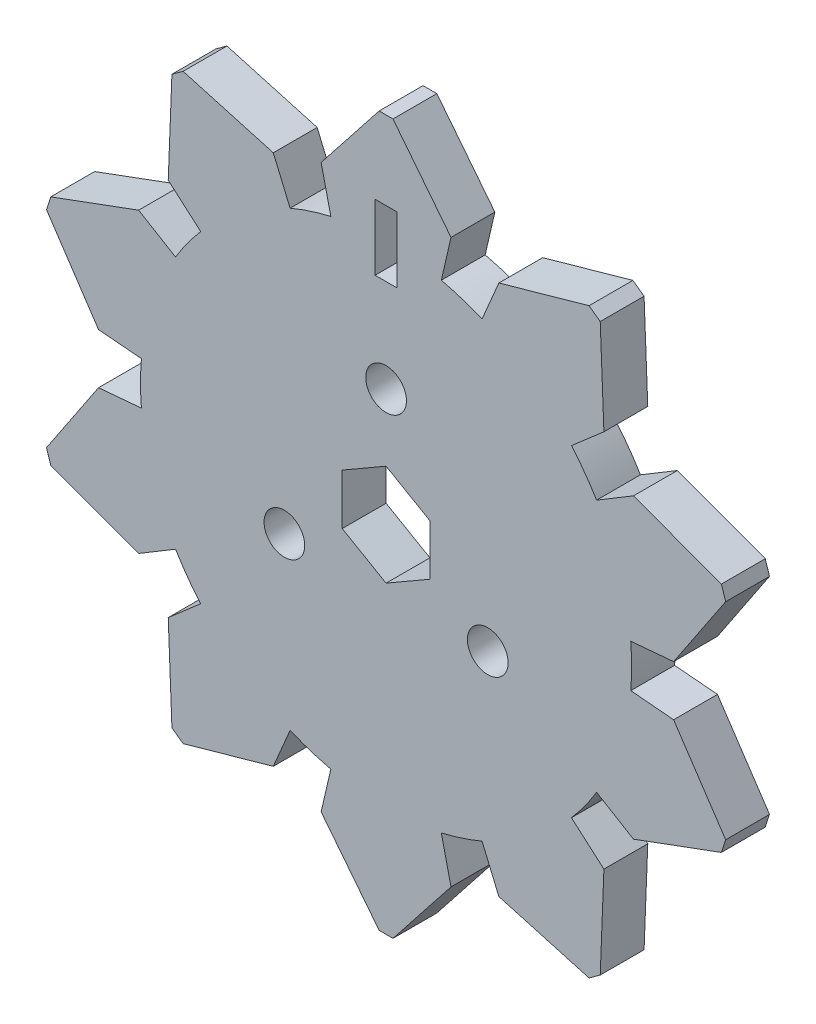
ISO-10303-21;
HEADER;
FILE_DESCRIPTION(('STEP AP214'),'2;1');
FILE_NAME('part.step','',(''),(''),'','','');
FILE_SCHEMA(('AUTOMOTIVE_DESIGN { 1 0 10303 214 1 1 1 1 }'));
ENDSEC;
DATA;
#1=APPLICATION_CONTEXT('core data for automotive mechanical design processes');
#2=APPLICATION_PROTOCOL_DEFINITION('international standard','automotive_design',2000,#1);
#3=PRODUCT_CONTEXT('',#1,'mechanical');
#4=PRODUCT('Part','Part','',(#3));
#5=PRODUCT_RELATED_PRODUCT_CATEGORY('part','',(#4));
#6=PRODUCT_DEFINITION_FORMATION('','',#4);
#7=PRODUCT_DEFINITION_CONTEXT('part definition',#1,'design');
#8=PRODUCT_DEFINITION('design','',#6,#7);
#9=PRODUCT_DEFINITION_SHAPE('','',#8);
#10=(LENGTH_UNIT() NAMED_UNIT(*) SI_UNIT(.MILLI.,.METRE.));
#11=(NAMED_UNIT(*) PLANE_ANGLE_UNIT() SI_UNIT($,.RADIAN.));
#12=(NAMED_UNIT(*) SI_UNIT($,.STERADIAN.) SOLID_ANGLE_UNIT());
#13=UNCERTAINTY_MEASURE_WITH_UNIT(LENGTH_MEASURE(1.E-05),#10,'distance_accuracy_value','');
#14=(GEOMETRIC_REPRESENTATION_CONTEXT(3) GLOBAL_UNCERTAINTY_ASSIGNED_CONTEXT((#13)) GLOBAL_UNIT_ASSIGNED_CONTEXT((#10,
#11,#12)) REPRESENTATION_CONTEXT('',''));
#15=CARTESIAN_POINT('',(0.,0.,0.));
#16=DIRECTION('',(0.,0.,1.));
#17=DIRECTION('',(1.,0.,0.));
#18=AXIS2_PLACEMENT_3D('',#15,#16,#17);
#19=CARTESIAN_POINT('',(0.,0.,3.175));
#20=DIRECTION('',(0.,0.,-1.));
#21=DIRECTION('',(-1.,0.,0.));
#22=AXIS2_PLACEMENT_3D('',#19,#20,#21);
#23=PLANE('',#22);
#24=DIRECTION('',(1.,0.,0.));
#25=VECTOR('',#24,1.);
#26=CARTESIAN_POINT('',(-0.79375,15.24,3.175));
#27=LINE('',#26,#25);
#28=CARTESIAN_POINT('',(-0.79375,15.24,3.175));
#29=VERTEX_POINT('',#28);
#30=CARTESIAN_POINT('',(0.79375,15.24,3.175));
#31=VERTEX_POINT('',#30);
#32=EDGE_CURVE('E497',#29,#31,#27,.T.);
#33=ORIENTED_EDGE('',*,*,#32,.F.);
#34=DIRECTION('',(0.,-1.,0.));
#35=VECTOR('',#34,1.);
#36=CARTESIAN_POINT('',(-0.793750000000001,20.0025,3.175));
#37=LINE('',#36,#35);
#38=CARTESIAN_POINT('',(-0.793750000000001,20.0025,3.175));
#39=VERTEX_POINT('',#38);
#40=EDGE_CURVE('E48',#39,#29,#37,.T.);
#41=ORIENTED_EDGE('',*,*,#40,.F.);
#42=DIRECTION('',(-1.,0.,0.));
#43=VECTOR('',#42,1.);
#44=CARTESIAN_POINT('',(-0.793750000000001,20.0025,3.175));
#45=LINE('',#44,#43);
#46=CARTESIAN_POINT('',(0.793750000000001,20.0025,3.175));
#47=VERTEX_POINT('',#46);
#48=EDGE_CURVE('E488',#47,#39,#45,.T.);
#49=ORIENTED_EDGE('',*,*,#48,.F.);
#50=DIRECTION('',(0.,1.,0.));
#51=VECTOR('',#50,1.);
#52=CARTESIAN_POINT('',(0.793750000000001,20.0025,3.175));
#53=LINE('',#52,#51);
#54=EDGE_CURVE('E491',#31,#47,#53,.T.);
#55=ORIENTED_EDGE('',*,*,#54,.F.);
#56=EDGE_LOOP('',(#33,#41,#49,#55));
#57=FACE_BOUND('',#56,.T.);
#58=CARTESIAN_POINT('',(7.36121593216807,-4.2499999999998,3.175));
#59=DIRECTION('',(0.,0.,1.));
#60=DIRECTION('',(1.,0.,0.));
#61=AXIS2_PLACEMENT_3D('',#58,#59,#60);
#62=CIRCLE('',#61,1.4732);
#63=CARTESIAN_POINT('',(8.83441593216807,-4.2499999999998,3.175));
#64=VERTEX_POINT('',#63);
#65=EDGE_CURVE('E512',#64,#64,#62,.T.);
#66=ORIENTED_EDGE('',*,*,#65,.F.);
#67=EDGE_LOOP('',(#66));
#68=FACE_BOUND('',#67,.T.);
#69=CARTESIAN_POINT('',(-7.36121593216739,-4.25000000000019,3.175));
#70=DIRECTION('',(0.,0.,1.));
#71=DIRECTION('',(1.,0.,0.));
#72=AXIS2_PLACEMENT_3D('',#69,#70,#71);
#73=CIRCLE('',#72,1.4732);
#74=CARTESIAN_POINT('',(-5.8880159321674,-4.25000000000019,3.175));
#75=VERTEX_POINT('',#74);
#76=EDGE_CURVE('E518',#75,#75,#73,.T.);
#77=ORIENTED_EDGE('',*,*,#76,.F.);
#78=EDGE_LOOP('',(#77));
#79=FACE_BOUND('',#78,.T.);
#80=CARTESIAN_POINT('',(0.,0.,3.175));
#81=DIRECTION('',(0.,0.,1.));
#82=DIRECTION('',(-1.,0.,0.));
#83=AXIS2_PLACEMENT_3D('',#80,#81,#82);
#84=CIRCLE('',#83,17.78);
#85=CARTESIAN_POINT('',(-3.99962974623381,17.3242997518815,3.175));
#86=VERTEX_POINT('',#85);
#87=CARTESIAN_POINT('',(-6.94719946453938,16.3665762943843,3.175));
#88=VERTEX_POINT('',#87);
#89=EDGE_CURVE('E570',#86,#88,#84,.T.);
#90=ORIENTED_EDGE('',*,*,#89,.T.);
#91=DIRECTION('',(-0.390731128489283,0.920504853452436,0.));
#92=VECTOR('',#91,1.);
#93=CARTESIAN_POINT('',(-6.94719946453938,16.3665762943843,3.175));
#94=LINE('',#93,#92);
#95=CARTESIAN_POINT('',(-8.16435366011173,19.2340118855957,3.175));
#96=VERTEX_POINT('',#95);
#97=EDGE_CURVE('E573',#88,#96,#94,.T.);
#98=ORIENTED_EDGE('',*,*,#97,.T.);
#99=DIRECTION('',(-0.962489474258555,0.271319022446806,0.));
#100=VECTOR('',#99,1.);
#101=CARTESIAN_POINT('',(-8.16435366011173,19.2340118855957,3.175));
#102=LINE('',#101,#100);
#103=CARTESIAN_POINT('',(-14.6935126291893,21.0745359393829,3.175));
#104=VERTEX_POINT('',#103);
#105=EDGE_CURVE('E576',#96,#104,#102,.T.);
#106=ORIENTED_EDGE('',*,*,#105,.T.);
#107=DIRECTION('',(-0.809016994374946,-0.587785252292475,0.));
#108=VECTOR('',#107,1.);
#109=CARTESIAN_POINT('',(-15.5025296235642,20.4867506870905,3.175));
#110=LINE('',#109,#108);
#111=CARTESIAN_POINT('',(-15.5025296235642,20.4867506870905,3.175));
#112=VERTEX_POINT('',#111);
#113=EDGE_CURVE('E578',#104,#112,#110,.T.);
#114=ORIENTED_EDGE('',*,*,#113,.T.);
#115=DIRECTION('',(-0.0393858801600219,-0.999224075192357,0.));
#116=VECTOR('',#115,1.);
#117=CARTESIAN_POINT('',(-15.7697083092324,13.7083982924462,3.175));
#118=LINE('',#117,#116);
#119=CARTESIAN_POINT('',(-15.7697083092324,13.7083982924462,3.175));
#120=VERTEX_POINT('',#119);
#121=EDGE_CURVE('E580',#112,#120,#118,.T.);
#122=ORIENTED_EDGE('',*,*,#121,.T.);
#123=DIRECTION('',(0.754709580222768,-0.656059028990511,0.));
#124=VECTOR('',#123,1.);
#125=CARTESIAN_POINT('',(-13.4187363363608,11.6647295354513,3.175));
#126=LINE('',#125,#124);
#127=CARTESIAN_POINT('',(-13.4187363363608,11.6647295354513,3.175));
#128=VERTEX_POINT('',#127);
#129=EDGE_CURVE('E582',#120,#128,#126,.T.);
#130=ORIENTED_EDGE('',*,*,#129,.T.);
#131=CARTESIAN_POINT('',(0.,0.,3.175));
#132=DIRECTION('',(0.,0.,1.));
#133=DIRECTION('',(-1.,0.,0.));
#134=AXIS2_PLACEMENT_3D('',#131,#132,#133);
#135=CIRCLE('',#134,17.78);
#136=CARTESIAN_POINT('',(-15.2404346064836,9.15737697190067,3.175));
#137=VERTEX_POINT('',#136);
#138=EDGE_CURVE('E584',#128,#137,#135,.T.);
#139=ORIENTED_EDGE('',*,*,#138,.T.);
#140=DIRECTION('',(-0.857167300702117,0.515038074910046,0.));
#141=VECTOR('',#140,1.);
#142=CARTESIAN_POINT('',(-15.2404346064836,9.15737697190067,3.175));
#143=LINE('',#142,#141);
#144=CARTESIAN_POINT('',(-17.910569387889,10.7617558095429,3.175));
#145=VERTEX_POINT('',#144);
#146=EDGE_CURVE('E586',#137,#145,#143,.T.);
#147=ORIENTED_EDGE('',*,*,#146,.T.);
#148=DIRECTION('',(-0.938147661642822,-0.346235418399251,0.));
#149=VECTOR('',#148,1.);
#150=CARTESIAN_POINT('',(-17.910569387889,10.7617558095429,3.175));
#151=LINE('',#150,#149);
#152=CARTESIAN_POINT('',(-24.274602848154,8.41302769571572,3.175));
#153=VERTEX_POINT('',#152);
#154=EDGE_CURVE('E588',#145,#153,#151,.T.);
#155=ORIENTED_EDGE('',*,*,#154,.T.);
#156=DIRECTION('',(-0.309016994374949,-0.951056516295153,0.));
#157=VECTOR('',#156,1.);
#158=CARTESIAN_POINT('',(-24.583619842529,7.46197117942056,3.175));
#159=LINE('',#158,#157);
#160=CARTESIAN_POINT('',(-24.583619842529,7.46197117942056,3.175));
#161=VERTEX_POINT('',#160);
#162=EDGE_CURVE('E590',#153,#161,#159,.T.);
#163=ORIENTED_EDGE('',*,*,#162,.T.);
#164=DIRECTION('',(0.55546532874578,-0.831539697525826,0.));
#165=VECTOR('',#164,1.);
#166=CARTESIAN_POINT('',(-20.815556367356,1.82112520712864,3.175));
#167=LINE('',#166,#165);
#168=CARTESIAN_POINT('',(-20.815556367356,1.82112520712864,3.175));
#169=VERTEX_POINT('',#168);
#170=EDGE_CURVE('E592',#161,#169,#167,.T.);
#171=ORIENTED_EDGE('',*,*,#170,.T.);
#172=DIRECTION('',(0.996194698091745,-0.0871557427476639,0.));
#173=VECTOR('',#172,1.);
#174=CARTESIAN_POINT('',(-17.7123417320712,1.54962910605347,3.175));
#175=LINE('',#174,#173);
#176=CARTESIAN_POINT('',(-17.7123417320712,1.54962910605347,3.175));
#177=VERTEX_POINT('',#176);
#178=EDGE_CURVE('E594',#169,#177,#175,.T.);
#179=ORIENTED_EDGE('',*,*,#178,.T.);
#180=CARTESIAN_POINT('',(0.,0.,3.175));
#181=DIRECTION('',(0.,0.,1.));
#182=DIRECTION('',(-1.,0.,0.));
#183=AXIS2_PLACEMENT_3D('',#180,#181,#182);
#184=CIRCLE('',#183,17.78);
#185=CARTESIAN_POINT('',(-17.7123417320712,-1.54962910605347,3.175));
#186=VERTEX_POINT('',#185);
#187=EDGE_CURVE('E596',#177,#186,#184,.T.);
#188=ORIENTED_EDGE('',*,*,#187,.T.);
#189=DIRECTION('',(-0.996194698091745,-0.0871557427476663,0.));
#190=VECTOR('',#189,1.);
#191=CARTESIAN_POINT('',(-17.7123417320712,-1.54962910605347,3.175));
#192=LINE('',#191,#190);
#193=CARTESIAN_POINT('',(-20.815556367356,-1.82112520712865,3.175));
#194=VERTEX_POINT('',#193);
#195=EDGE_CURVE('E598',#186,#194,#192,.T.);
#196=ORIENTED_EDGE('',*,*,#195,.T.);
#197=DIRECTION('',(-0.555465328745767,-0.831539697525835,0.));
#198=VECTOR('',#197,1.);
#199=CARTESIAN_POINT('',(-20.815556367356,-1.82112520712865,3.175));
#200=LINE('',#199,#198);
#201=CARTESIAN_POINT('',(-24.5836198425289,-7.46197117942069,3.175));
#202=VERTEX_POINT('',#201);
#203=EDGE_CURVE('E600',#194,#202,#200,.T.);
#204=ORIENTED_EDGE('',*,*,#203,.T.);
#205=DIRECTION('',(0.309016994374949,-0.951056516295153,0.));
#206=VECTOR('',#205,1.);
#207=CARTESIAN_POINT('',(-24.274602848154,-8.41302769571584,3.175));
#208=LINE('',#207,#206);
#209=CARTESIAN_POINT('',(-24.274602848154,-8.41302769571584,3.175));
#210=VERTEX_POINT('',#209);
#211=EDGE_CURVE('E602',#202,#210,#208,.T.);
#212=ORIENTED_EDGE('',*,*,#211,.T.);
#213=DIRECTION('',(0.938147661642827,-0.346235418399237,0.));
#214=VECTOR('',#213,1.);
#215=CARTESIAN_POINT('',(-17.910569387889,-10.7617558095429,3.175));
#216=LINE('',#215,#214);
#217=CARTESIAN_POINT('',(-17.910569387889,-10.7617558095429,3.175));
#218=VERTEX_POINT('',#217);
#219=EDGE_CURVE('E604',#210,#218,#216,.T.);
#220=ORIENTED_EDGE('',*,*,#219,.T.);
#221=DIRECTION('',(0.857167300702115,0.515038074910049,0.));
#222=VECTOR('',#221,1.);
#223=CARTESIAN_POINT('',(-15.2404346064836,-9.15737697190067,3.175));
#224=LINE('',#223,#222);
#225=CARTESIAN_POINT('',(-15.2404346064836,-9.15737697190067,3.175));
#226=VERTEX_POINT('',#225);
#227=EDGE_CURVE('E606',#218,#226,#224,.T.);
#228=ORIENTED_EDGE('',*,*,#227,.T.);
#229=CARTESIAN_POINT('',(0.,0.,3.175));
#230=DIRECTION('',(0.,0.,1.));
#231=DIRECTION('',(-1.,0.,0.));
#232=AXIS2_PLACEMENT_3D('',#229,#230,#231);
#233=CIRCLE('',#232,17.78);
#234=CARTESIAN_POINT('',(-13.4187363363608,-11.6647295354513,3.175));
#235=VERTEX_POINT('',#234);
#236=EDGE_CURVE('E608',#226,#235,#233,.T.);
#237=ORIENTED_EDGE('',*,*,#236,.T.);
#238=DIRECTION('',(-0.754709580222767,-0.656059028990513,0.));
#239=VECTOR('',#238,1.);
#240=CARTESIAN_POINT('',(-13.4187363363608,-11.6647295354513,3.175));
#241=LINE('',#240,#239);
#242=CARTESIAN_POINT('',(-15.7697083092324,-13.7083982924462,3.175));
#243=VERTEX_POINT('',#242);
#244=EDGE_CURVE('E610',#235,#243,#241,.T.);
#245=ORIENTED_EDGE('',*,*,#244,.T.);
#246=DIRECTION('',(0.0393858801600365,-0.999224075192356,0.));
#247=VECTOR('',#246,1.);
#248=CARTESIAN_POINT('',(-15.7697083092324,-13.7083982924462,3.175));
#249=LINE('',#248,#247);
#250=CARTESIAN_POINT('',(-15.5025296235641,-20.4867506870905,3.175));
#251=VERTEX_POINT('',#250);
#252=EDGE_CURVE('E612',#243,#251,#249,.T.);
#253=ORIENTED_EDGE('',*,*,#252,.T.);
#254=DIRECTION('',(0.809016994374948,-0.587785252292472,0.));
#255=VECTOR('',#254,1.);
#256=CARTESIAN_POINT('',(-14.6935126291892,-21.074535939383,3.175));
#257=LINE('',#256,#255);
#258=CARTESIAN_POINT('',(-14.6935126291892,-21.074535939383,3.175));
#259=VERTEX_POINT('',#258);
#260=EDGE_CURVE('E614',#251,#259,#257,.T.);
#261=ORIENTED_EDGE('',*,*,#260,.T.);
#262=DIRECTION('',(0.962489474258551,0.27131902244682,0.));
#263=VECTOR('',#262,1.);
#264=CARTESIAN_POINT('',(-8.16435366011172,-19.2340118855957,3.175));
#265=LINE('',#264,#263);
#266=CARTESIAN_POINT('',(-8.16435366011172,-19.2340118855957,3.175));
#267=VERTEX_POINT('',#266);
#268=EDGE_CURVE('E616',#259,#267,#265,.T.);
#269=ORIENTED_EDGE('',*,*,#268,.T.);
#270=DIRECTION('',(0.39073112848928,0.920504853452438,0.));
#271=VECTOR('',#270,1.);
#272=CARTESIAN_POINT('',(-6.94719946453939,-16.3665762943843,3.175));
#273=LINE('',#272,#271);
#274=CARTESIAN_POINT('',(-6.94719946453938,-16.3665762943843,3.175));
#275=VERTEX_POINT('',#274);
#276=EDGE_CURVE('E618',#267,#275,#273,.T.);
#277=ORIENTED_EDGE('',*,*,#276,.T.);
#278=CARTESIAN_POINT('',(0.,0.,3.175));
#279=DIRECTION('',(0.,0.,1.));
#280=DIRECTION('',(-1.,0.,0.));
#281=AXIS2_PLACEMENT_3D('',#278,#279,#280);
#282=CIRCLE('',#281,17.78);
#283=CARTESIAN_POINT('',(-3.99962974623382,-17.3242997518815,3.175));
#284=VERTEX_POINT('',#283);
#285=EDGE_CURVE('E620',#275,#284,#282,.T.);
#286=ORIENTED_EDGE('',*,*,#285,.T.);
#287=DIRECTION('',(-0.224951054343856,-0.974370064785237,0.));
#288=VECTOR('',#287,1.);
#289=CARTESIAN_POINT('',(-3.99962974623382,-17.3242997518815,3.175));
#290=LINE('',#289,#288);
#291=CARTESIAN_POINT('',(-4.70036766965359,-20.3595291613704,3.175));
#292=VERTEX_POINT('',#291);
#293=EDGE_CURVE('E622',#284,#292,#290,.T.);
#294=ORIENTED_EDGE('',*,*,#293,.T.);
#295=DIRECTION('',(0.619193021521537,-0.785238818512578,0.));
#296=VECTOR('',#295,1.);
#297=CARTESIAN_POINT('',(-4.70036766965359,-20.3595291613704,3.175));
#298=LINE('',#297,#296);
#299=CARTESIAN_POINT('',(-0.499999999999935,-25.6862877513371,3.175));
#300=VERTEX_POINT('',#299);
#301=EDGE_CURVE('E624',#292,#300,#298,.T.);
#302=ORIENTED_EDGE('',*,*,#301,.T.);
#303=DIRECTION('',(1.,0.,0.));
#304=VECTOR('',#303,1.);
#305=CARTESIAN_POINT('',(0.500000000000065,-25.6862877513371,3.175));
#306=LINE('',#305,#304);
#307=CARTESIAN_POINT('',(0.500000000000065,-25.6862877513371,3.175));
#308=VERTEX_POINT('',#307);
#309=EDGE_CURVE('E626',#300,#308,#306,.T.);
#310=ORIENTED_EDGE('',*,*,#309,.T.);
#311=DIRECTION('',(0.619193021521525,0.785238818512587,0.));
#312=VECTOR('',#311,1.);
#313=CARTESIAN_POINT('',(4.7003676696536,-20.3595291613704,3.175));
#314=LINE('',#313,#312);
#315=CARTESIAN_POINT('',(4.7003676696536,-20.3595291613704,3.175));
#316=VERTEX_POINT('',#315);
#317=EDGE_CURVE('E628',#308,#316,#314,.T.);
#318=ORIENTED_EDGE('',*,*,#317,.T.);
#319=DIRECTION('',(-0.224951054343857,0.974370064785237,0.));
#320=VECTOR('',#319,1.);
#321=CARTESIAN_POINT('',(3.99962974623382,-17.3242997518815,3.175));
#322=LINE('',#321,#320);
#323=CARTESIAN_POINT('',(3.99962974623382,-17.3242997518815,3.175));
#324=VERTEX_POINT('',#323);
#325=EDGE_CURVE('E630',#316,#324,#322,.T.);
#326=ORIENTED_EDGE('',*,*,#325,.T.);
#327=CARTESIAN_POINT('',(0.,0.,3.175));
#328=DIRECTION('',(0.,0.,1.));
#329=DIRECTION('',(-1.,0.,0.));
#330=AXIS2_PLACEMENT_3D('',#327,#328,#329);
#331=CIRCLE('',#330,17.78);
#332=CARTESIAN_POINT('',(6.94719946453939,-16.3665762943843,3.175));
#333=VERTEX_POINT('',#332);
#334=EDGE_CURVE('E632',#324,#333,#331,.T.);
#335=ORIENTED_EDGE('',*,*,#334,.T.);
#336=DIRECTION('',(0.390731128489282,-0.920504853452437,0.));
#337=VECTOR('',#336,1.);
#338=CARTESIAN_POINT('',(6.94719946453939,-16.3665762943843,3.175));
#339=LINE('',#338,#337);
#340=CARTESIAN_POINT('',(8.16435366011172,-19.2340118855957,3.175));
#341=VERTEX_POINT('',#340);
#342=EDGE_CURVE('E634',#333,#341,#339,.T.);
#343=ORIENTED_EDGE('',*,*,#342,.T.);
#344=DIRECTION('',(0.962489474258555,-0.271319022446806,0.));
#345=VECTOR('',#344,1.);
#346=CARTESIAN_POINT('',(8.16435366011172,-19.2340118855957,3.175));
#347=LINE('',#346,#345);
#348=CARTESIAN_POINT('',(14.6935126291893,-21.0745359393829,3.175));
#349=VERTEX_POINT('',#348);
#350=EDGE_CURVE('E636',#341,#349,#347,.T.);
#351=ORIENTED_EDGE('',*,*,#350,.T.);
#352=DIRECTION('',(0.809016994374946,0.587785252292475,0.));
#353=VECTOR('',#352,1.);
#354=CARTESIAN_POINT('',(15.5025296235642,-20.4867506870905,3.175));
#355=LINE('',#354,#353);
#356=CARTESIAN_POINT('',(15.5025296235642,-20.4867506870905,3.175));
#357=VERTEX_POINT('',#356);
#358=EDGE_CURVE('E638',#349,#357,#355,.T.);
#359=ORIENTED_EDGE('',*,*,#358,.T.);
#360=DIRECTION('',(0.0393858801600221,0.999224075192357,0.));
#361=VECTOR('',#360,1.);
#362=CARTESIAN_POINT('',(15.7697083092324,-13.7083982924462,3.175));
#363=LINE('',#362,#361);
#364=CARTESIAN_POINT('',(15.7697083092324,-13.7083982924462,3.175));
#365=VERTEX_POINT('',#364);
#366=EDGE_CURVE('E640',#357,#365,#363,.T.);
#367=ORIENTED_EDGE('',*,*,#366,.T.);
#368=DIRECTION('',(-0.754709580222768,0.656059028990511,0.));
#369=VECTOR('',#368,1.);
#370=CARTESIAN_POINT('',(13.4187363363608,-11.6647295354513,3.175));
#371=LINE('',#370,#369);
#372=CARTESIAN_POINT('',(13.4187363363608,-11.6647295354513,3.175));
#373=VERTEX_POINT('',#372);
#374=EDGE_CURVE('E642',#365,#373,#371,.T.);
#375=ORIENTED_EDGE('',*,*,#374,.T.);
#376=CARTESIAN_POINT('',(0.,0.,3.175));
#377=DIRECTION('',(0.,0.,1.));
#378=DIRECTION('',(-1.,0.,0.));
#379=AXIS2_PLACEMENT_3D('',#376,#377,#378);
#380=CIRCLE('',#379,17.78);
#381=CARTESIAN_POINT('',(15.2404346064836,-9.15737697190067,3.175));
#382=VERTEX_POINT('',#381);
#383=EDGE_CURVE('E644',#373,#382,#380,.T.);
#384=ORIENTED_EDGE('',*,*,#383,.T.);
#385=DIRECTION('',(0.857167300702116,-0.515038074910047,0.));
#386=VECTOR('',#385,1.);
#387=CARTESIAN_POINT('',(15.2404346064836,-9.15737697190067,3.175));
#388=LINE('',#387,#386);
#389=CARTESIAN_POINT('',(17.910569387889,-10.7617558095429,3.175));
#390=VERTEX_POINT('',#389);
#391=EDGE_CURVE('E646',#382,#390,#388,.T.);
#392=ORIENTED_EDGE('',*,*,#391,.T.);
#393=DIRECTION('',(0.938147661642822,0.346235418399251,0.));
#394=VECTOR('',#393,1.);
#395=CARTESIAN_POINT('',(17.910569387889,-10.7617558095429,3.175));
#396=LINE('',#395,#394);
#397=CARTESIAN_POINT('',(24.274602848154,-8.41302769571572,3.175));
#398=VERTEX_POINT('',#397);
#399=EDGE_CURVE('E648',#390,#398,#396,.T.);
#400=ORIENTED_EDGE('',*,*,#399,.T.);
#401=DIRECTION('',(0.309016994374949,0.951056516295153,0.));
#402=VECTOR('',#401,1.);
#403=CARTESIAN_POINT('',(24.583619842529,-7.46197117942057,3.175));
#404=LINE('',#403,#402);
#405=CARTESIAN_POINT('',(24.583619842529,-7.46197117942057,3.175));
#406=VERTEX_POINT('',#405);
#407=EDGE_CURVE('E650',#398,#406,#404,.T.);
#408=ORIENTED_EDGE('',*,*,#407,.T.);
#409=DIRECTION('',(-0.55546532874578,0.831539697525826,0.));
#410=VECTOR('',#409,1.);
#411=CARTESIAN_POINT('',(20.815556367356,-1.82112520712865,3.175));
#412=LINE('',#411,#410);
#413=CARTESIAN_POINT('',(20.815556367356,-1.82112520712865,3.175));
#414=VERTEX_POINT('',#413);
#415=EDGE_CURVE('E652',#406,#414,#412,.T.);
#416=ORIENTED_EDGE('',*,*,#415,.T.);
#417=DIRECTION('',(-0.996194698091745,0.0871557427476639,0.));
#418=VECTOR('',#417,1.);
#419=CARTESIAN_POINT('',(17.7123417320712,-1.54962910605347,3.175));
#420=LINE('',#419,#418);
#421=CARTESIAN_POINT('',(17.7123417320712,-1.54962910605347,3.175));
#422=VERTEX_POINT('',#421);
#423=EDGE_CURVE('E654',#414,#422,#420,.T.);
#424=ORIENTED_EDGE('',*,*,#423,.T.);
#425=CARTESIAN_POINT('',(0.,0.,3.175));
#426=DIRECTION('',(0.,0.,1.));
#427=DIRECTION('',(-1.,0.,0.));
#428=AXIS2_PLACEMENT_3D('',#425,#426,#427);
#429=CIRCLE('',#428,17.78);
#430=CARTESIAN_POINT('',(17.7123417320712,1.54962910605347,3.175));
#431=VERTEX_POINT('',#430);
#432=EDGE_CURVE('E656',#422,#431,#429,.T.);
#433=ORIENTED_EDGE('',*,*,#432,.T.);
#434=DIRECTION('',(0.996194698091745,0.0871557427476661,0.));
#435=VECTOR('',#434,1.);
#436=CARTESIAN_POINT('',(17.7123417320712,1.54962910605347,3.175));
#437=LINE('',#436,#435);
#438=CARTESIAN_POINT('',(20.815556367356,1.82112520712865,3.175));
#439=VERTEX_POINT('',#438);
#440=EDGE_CURVE('E658',#431,#439,#437,.T.);
#441=ORIENTED_EDGE('',*,*,#440,.T.);
#442=DIRECTION('',(0.555465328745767,0.831539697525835,0.));
#443=VECTOR('',#442,1.);
#444=CARTESIAN_POINT('',(20.815556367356,1.82112520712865,3.175));
#445=LINE('',#444,#443);
#446=CARTESIAN_POINT('',(24.583619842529,7.46197117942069,3.175));
#447=VERTEX_POINT('',#446);
#448=EDGE_CURVE('E660',#439,#447,#445,.T.);
#449=ORIENTED_EDGE('',*,*,#448,.T.);
#450=DIRECTION('',(-0.309016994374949,0.951056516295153,0.));
#451=VECTOR('',#450,1.);
#452=CARTESIAN_POINT('',(24.274602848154,8.41302769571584,3.175));
#453=LINE('',#452,#451);
#454=CARTESIAN_POINT('',(24.274602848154,8.41302769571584,3.175));
#455=VERTEX_POINT('',#454);
#456=EDGE_CURVE('E662',#447,#455,#453,.T.);
#457=ORIENTED_EDGE('',*,*,#456,.T.);
#458=DIRECTION('',(-0.938147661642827,0.346235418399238,0.));
#459=VECTOR('',#458,1.);
#460=CARTESIAN_POINT('',(17.910569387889,10.7617558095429,3.175));
#461=LINE('',#460,#459);
#462=CARTESIAN_POINT('',(17.910569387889,10.7617558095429,3.175));
#463=VERTEX_POINT('',#462);
#464=EDGE_CURVE('E664',#455,#463,#461,.T.);
#465=ORIENTED_EDGE('',*,*,#464,.T.);
#466=DIRECTION('',(-0.857167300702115,-0.51503807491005,0.));
#467=VECTOR('',#466,1.);
#468=CARTESIAN_POINT('',(15.2404346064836,9.15737697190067,3.175));
#469=LINE('',#468,#467);
#470=CARTESIAN_POINT('',(15.2404346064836,9.15737697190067,3.175));
#471=VERTEX_POINT('',#470);
#472=EDGE_CURVE('E666',#463,#471,#469,.T.);
#473=ORIENTED_EDGE('',*,*,#472,.T.);
#474=CARTESIAN_POINT('',(0.,0.,3.175));
#475=DIRECTION('',(0.,0.,1.));
#476=DIRECTION('',(-1.,0.,0.));
#477=AXIS2_PLACEMENT_3D('',#474,#475,#476);
#478=CIRCLE('',#477,17.78);
#479=CARTESIAN_POINT('',(13.4187363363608,11.6647295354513,3.175));
#480=VERTEX_POINT('',#479);
#481=EDGE_CURVE('E668',#471,#480,#478,.T.);
#482=ORIENTED_EDGE('',*,*,#481,.T.);
#483=DIRECTION('',(0.754709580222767,0.656059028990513,0.));
#484=VECTOR('',#483,1.);
#485=CARTESIAN_POINT('',(13.4187363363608,11.6647295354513,3.175));
#486=LINE('',#485,#484);
#487=CARTESIAN_POINT('',(15.7697083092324,13.7083982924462,3.175));
#488=VERTEX_POINT('',#487);
#489=EDGE_CURVE('E670',#480,#488,#486,.T.);
#490=ORIENTED_EDGE('',*,*,#489,.T.);
#491=DIRECTION('',(-0.0393858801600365,0.999224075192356,0.));
#492=VECTOR('',#491,1.);
#493=CARTESIAN_POINT('',(15.7697083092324,13.7083982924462,3.175));
#494=LINE('',#493,#492);
#495=CARTESIAN_POINT('',(15.5025296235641,20.4867506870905,3.175));
#496=VERTEX_POINT('',#495);
#497=EDGE_CURVE('E672',#488,#496,#494,.T.);
#498=ORIENTED_EDGE('',*,*,#497,.T.);
#499=DIRECTION('',(-0.809016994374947,0.587785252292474,0.));
#500=VECTOR('',#499,1.);
#501=CARTESIAN_POINT('',(14.6935126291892,21.074535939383,3.175));
#502=LINE('',#501,#500);
#503=CARTESIAN_POINT('',(14.6935126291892,21.074535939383,3.175));
#504=VERTEX_POINT('',#503);
#505=EDGE_CURVE('E674',#496,#504,#502,.T.);
#506=ORIENTED_EDGE('',*,*,#505,.T.);
#507=DIRECTION('',(-0.962489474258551,-0.27131902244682,0.));
#508=VECTOR('',#507,1.);
#509=CARTESIAN_POINT('',(8.16435366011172,19.2340118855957,3.175));
#510=LINE('',#509,#508);
#511=CARTESIAN_POINT('',(8.16435366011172,19.2340118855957,3.175));
#512=VERTEX_POINT('',#511);
#513=EDGE_CURVE('E676',#504,#512,#510,.T.);
#514=ORIENTED_EDGE('',*,*,#513,.T.);
#515=DIRECTION('',(-0.39073112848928,-0.920504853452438,0.));
#516=VECTOR('',#515,1.);
#517=CARTESIAN_POINT('',(6.94719946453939,16.3665762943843,3.175));
#518=LINE('',#517,#516);
#519=CARTESIAN_POINT('',(6.94719946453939,16.3665762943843,3.175));
#520=VERTEX_POINT('',#519);
#521=EDGE_CURVE('E678',#512,#520,#518,.T.);
#522=ORIENTED_EDGE('',*,*,#521,.T.);
#523=CARTESIAN_POINT('',(0.,0.,3.175));
#524=DIRECTION('',(0.,0.,1.));
#525=DIRECTION('',(-1.,0.,0.));
#526=AXIS2_PLACEMENT_3D('',#523,#524,#525);
#527=CIRCLE('',#526,17.78);
#528=CARTESIAN_POINT('',(3.99962974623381,17.3242997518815,3.175));
#529=VERTEX_POINT('',#528);
#530=EDGE_CURVE('E680',#520,#529,#527,.T.);
#531=ORIENTED_EDGE('',*,*,#530,.T.);
#532=DIRECTION('',(0.224951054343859,0.974370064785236,0.));
#533=VECTOR('',#532,1.);
#534=CARTESIAN_POINT('',(3.99962974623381,17.3242997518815,3.175));
#535=LINE('',#534,#533);
#536=CARTESIAN_POINT('',(4.7003676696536,20.3595291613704,3.175));
#537=VERTEX_POINT('',#536);
#538=EDGE_CURVE('E682',#529,#537,#535,.T.);
#539=ORIENTED_EDGE('',*,*,#538,.T.);
#540=DIRECTION('',(-0.619193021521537,0.785238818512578,0.));
#541=VECTOR('',#540,1.);
#542=CARTESIAN_POINT('',(4.7003676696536,20.3595291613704,3.175));
#543=LINE('',#542,#541);
#544=CARTESIAN_POINT('',(0.499999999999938,25.6862877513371,3.175));
#545=VERTEX_POINT('',#544);
#546=EDGE_CURVE('E684',#537,#545,#543,.T.);
#547=ORIENTED_EDGE('',*,*,#546,.T.);
#548=DIRECTION('',(-1.,0.,0.));
#549=VECTOR('',#548,1.);
#550=CARTESIAN_POINT('',(-0.499999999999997,25.686287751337,3.175));
#551=LINE('',#550,#549);
#552=CARTESIAN_POINT('',(-0.499999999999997,25.686287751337,3.175));
#553=VERTEX_POINT('',#552);
#554=EDGE_CURVE('E686',#545,#553,#551,.T.);
#555=ORIENTED_EDGE('',*,*,#554,.T.);
#556=DIRECTION('',(-0.619193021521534,-0.785238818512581,0.));
#557=VECTOR('',#556,1.);
#558=CARTESIAN_POINT('',(-4.70036766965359,20.3595291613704,3.175));
#559=LINE('',#558,#557);
#560=CARTESIAN_POINT('',(-4.70036766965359,20.3595291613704,3.175));
#561=VERTEX_POINT('',#560);
#562=EDGE_CURVE('E688',#553,#561,#559,.T.);
#563=ORIENTED_EDGE('',*,*,#562,.T.);
#564=DIRECTION('',(0.224951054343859,-0.974370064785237,0.));
#565=VECTOR('',#564,1.);
#566=CARTESIAN_POINT('',(-3.99962974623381,17.3242997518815,3.175));
#567=LINE('',#566,#565);
#568=EDGE_CURVE('E690',#561,#86,#567,.T.);
#569=ORIENTED_EDGE('',*,*,#568,.T.);
#570=EDGE_LOOP('',(#90,#98,#106,#114,#122,#130,#139,#147,#155,#163,#171,#179,#188,#196,#204,
#212,#220,#228,#237,#245,#253,#261,#269,#277,#286,#294,#302,#310,#318,#326,#335,#343,#351,#359,
#367,#375,#384,#392,#400,#408,#416,#424,#433,#441,#449,#457,#465,#473,#482,#490,#498,#506,#514,
#522,#531,#539,#547,#555,#563,#569));
#571=FACE_BOUND('',#570,.T.);
#572=DIRECTION('',(0.,1.,0.));
#573=VECTOR('',#572,1.);
#574=CARTESIAN_POINT('',(3.175,-1.83308710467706,3.175));
#575=LINE('',#574,#573);
#576=CARTESIAN_POINT('',(3.175,-1.83308710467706,3.175));
#577=VERTEX_POINT('',#576);
#578=CARTESIAN_POINT('',(3.175,1.83308710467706,3.175));
#579=VERTEX_POINT('',#578);
#580=EDGE_CURVE('E525',#577,#579,#575,.T.);
#581=ORIENTED_EDGE('',*,*,#580,.F.);
#582=DIRECTION('',(0.866025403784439,0.499999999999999,0.));
#583=VECTOR('',#582,1.);
#584=CARTESIAN_POINT('',(0.,-3.66617420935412,3.175));
#585=LINE('',#584,#583);
#586=CARTESIAN_POINT('',(0.,-3.66617420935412,3.175));
#587=VERTEX_POINT('',#586);
#588=EDGE_CURVE('E537',#587,#577,#585,.T.);
#589=ORIENTED_EDGE('',*,*,#588,.F.);
#590=DIRECTION('',(0.866025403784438,-0.500000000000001,0.));
#591=VECTOR('',#590,1.);
#592=CARTESIAN_POINT('',(-3.175,-1.83308710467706,3.175));
#593=LINE('',#592,#591);
#594=CARTESIAN_POINT('',(-3.175,-1.83308710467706,3.175));
#595=VERTEX_POINT('',#594);
#596=EDGE_CURVE('E534',#595,#587,#593,.T.);
#597=ORIENTED_EDGE('',*,*,#596,.F.);
#598=DIRECTION('',(0.,-1.,0.));
#599=VECTOR('',#598,1.);
#600=CARTESIAN_POINT('',(-3.175,1.83308710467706,3.175));
#601=LINE('',#600,#599);
#602=CARTESIAN_POINT('',(-3.175,1.83308710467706,3.175));
#603=VERTEX_POINT('',#602);
#604=EDGE_CURVE('E532',#603,#595,#601,.T.);
#605=ORIENTED_EDGE('',*,*,#604,.F.);
#606=DIRECTION('',(-0.866025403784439,-0.499999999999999,0.));
#607=VECTOR('',#606,1.);
#608=CARTESIAN_POINT('',(0.,3.66617420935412,3.175));
#609=LINE('',#608,#607);
#610=CARTESIAN_POINT('',(0.,3.66617420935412,3.175));
#611=VERTEX_POINT('',#610);
#612=EDGE_CURVE('E530',#611,#603,#609,.T.);
#613=ORIENTED_EDGE('',*,*,#612,.F.);
#614=DIRECTION('',(-0.866025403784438,0.500000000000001,0.));
#615=VECTOR('',#614,1.);
#616=CARTESIAN_POINT('',(3.175,1.83308710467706,3.175));
#617=LINE('',#616,#615);
#618=EDGE_CURVE('E527',#579,#611,#617,.T.);
#619=ORIENTED_EDGE('',*,*,#618,.F.);
#620=EDGE_LOOP('',(#581,#589,#597,#605,#613,#619));
#621=FACE_BOUND('',#620,.T.);
#622=CARTESIAN_POINT('',(0.,8.5,3.175));
#623=DIRECTION('',(0.,0.,1.));
#624=DIRECTION('',(1.,0.,0.));
#625=AXIS2_PLACEMENT_3D('',#622,#623,#624);
#626=CIRCLE('',#625,1.4732);
#627=CARTESIAN_POINT('',(1.4732,8.5,3.175));
#628=VERTEX_POINT('',#627);
#629=EDGE_CURVE('E503',#628,#628,#626,.T.);
#630=ORIENTED_EDGE('',*,*,#629,.F.);
#631=EDGE_LOOP('',(#630));
#632=FACE_BOUND('',#631,.T.);
#633=ADVANCED_FACE('F33',(#57,#68,#79,#571,#621,#632),#23,.F.);
#634=CARTESIAN_POINT('',(0.,0.,0.));
#635=DIRECTION('',(0.,0.,-1.));
#636=DIRECTION('',(-1.,0.,0.));
#637=AXIS2_PLACEMENT_3D('',#634,#635,#636);
#638=PLANE('',#637);
#639=DIRECTION('',(0.,-1.,0.));
#640=VECTOR('',#639,1.);
#641=CARTESIAN_POINT('',(-0.793750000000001,20.0025,0.));
#642=LINE('',#641,#640);
#643=CARTESIAN_POINT('',(-0.793750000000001,20.0025,0.));
#644=VERTEX_POINT('',#643);
#645=CARTESIAN_POINT('',(-0.79375,15.24,0.));
#646=VERTEX_POINT('',#645);
#647=EDGE_CURVE('E472',#644,#646,#642,.T.);
#648=ORIENTED_EDGE('',*,*,#647,.T.);
#649=DIRECTION('',(1.,0.,0.));
#650=VECTOR('',#649,1.);
#651=CARTESIAN_POINT('',(-0.79375,15.24,0.));
#652=LINE('',#651,#650);
#653=CARTESIAN_POINT('',(0.79375,15.24,0.));
#654=VERTEX_POINT('',#653);
#655=EDGE_CURVE('E481',#646,#654,#652,.T.);
#656=ORIENTED_EDGE('',*,*,#655,.T.);
#657=DIRECTION('',(0.,1.,0.));
#658=VECTOR('',#657,1.);
#659=CARTESIAN_POINT('',(0.793750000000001,20.0025,0.));
#660=LINE('',#659,#658);
#661=CARTESIAN_POINT('',(0.793750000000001,20.0025,0.));
#662=VERTEX_POINT('',#661);
#663=EDGE_CURVE('E56',#654,#662,#660,.T.);
#664=ORIENTED_EDGE('',*,*,#663,.T.);
#665=DIRECTION('',(-1.,0.,0.));
#666=VECTOR('',#665,1.);
#667=CARTESIAN_POINT('',(-0.793750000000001,20.0025,0.));
#668=LINE('',#667,#666);
#669=EDGE_CURVE('E478',#662,#644,#668,.T.);
#670=ORIENTED_EDGE('',*,*,#669,.T.);
#671=EDGE_LOOP('',(#648,#656,#664,#670));
#672=FACE_BOUND('',#671,.T.);
#673=CARTESIAN_POINT('',(7.36121593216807,-4.2499999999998,0.));
#674=DIRECTION('',(0.,0.,1.));
#675=DIRECTION('',(1.,0.,0.));
#676=AXIS2_PLACEMENT_3D('',#673,#674,#675);
#677=CIRCLE('',#676,1.4732);
#678=CARTESIAN_POINT('',(8.83441593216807,-4.2499999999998,0.));
#679=VERTEX_POINT('',#678);
#680=EDGE_CURVE('E515',#679,#679,#677,.T.);
#681=ORIENTED_EDGE('',*,*,#680,.T.);
#682=EDGE_LOOP('',(#681));
#683=FACE_BOUND('',#682,.T.);
#684=DIRECTION('',(0.866025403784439,0.499999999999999,0.));
#685=VECTOR('',#684,1.);
#686=CARTESIAN_POINT('',(0.,-3.66617420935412,0.));
#687=LINE('',#686,#685);
#688=CARTESIAN_POINT('',(0.,-3.66617420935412,0.));
#689=VERTEX_POINT('',#688);
#690=CARTESIAN_POINT('',(3.175,-1.83308710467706,0.));
#691=VERTEX_POINT('',#690);
#692=EDGE_CURVE('E528',#689,#691,#687,.T.);
#693=ORIENTED_EDGE('',*,*,#692,.T.);
#694=DIRECTION('',(0.,1.,0.));
#695=VECTOR('',#694,1.);
#696=CARTESIAN_POINT('',(3.175,-1.83308710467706,0.));
#697=LINE('',#696,#695);
#698=CARTESIAN_POINT('',(3.175,1.83308710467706,0.));
#699=VERTEX_POINT('',#698);
#700=EDGE_CURVE('E524',#691,#699,#697,.T.);
#701=ORIENTED_EDGE('',*,*,#700,.T.);
#702=DIRECTION('',(-0.866025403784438,0.500000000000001,0.));
#703=VECTOR('',#702,1.);
#704=CARTESIAN_POINT('',(3.175,1.83308710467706,0.));
#705=LINE('',#704,#703);
#706=CARTESIAN_POINT('',(0.,3.66617420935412,0.));
#707=VERTEX_POINT('',#706);
#708=EDGE_CURVE('E542',#699,#707,#705,.T.);
#709=ORIENTED_EDGE('',*,*,#708,.T.);
#710=DIRECTION('',(-0.866025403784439,-0.499999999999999,0.));
#711=VECTOR('',#710,1.);
#712=CARTESIAN_POINT('',(0.,3.66617420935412,0.));
#713=LINE('',#712,#711);
#714=CARTESIAN_POINT('',(-3.175,1.83308710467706,0.));
#715=VERTEX_POINT('',#714);
#716=EDGE_CURVE('E545',#707,#715,#713,.T.);
#717=ORIENTED_EDGE('',*,*,#716,.T.);
#718=DIRECTION('',(0.,-1.,0.));
#719=VECTOR('',#718,1.);
#720=CARTESIAN_POINT('',(-3.175,1.83308710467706,0.));
#721=LINE('',#720,#719);
#722=CARTESIAN_POINT('',(-3.175,-1.83308710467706,0.));
#723=VERTEX_POINT('',#722);
#724=EDGE_CURVE('E548',#715,#723,#721,.T.);
#725=ORIENTED_EDGE('',*,*,#724,.T.);
#726=DIRECTION('',(0.866025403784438,-0.500000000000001,0.));
#727=VECTOR('',#726,1.);
#728=CARTESIAN_POINT('',(-3.175,-1.83308710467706,0.));
#729=LINE('',#728,#727);
#730=EDGE_CURVE('E551',#723,#689,#729,.T.);
#731=ORIENTED_EDGE('',*,*,#730,.T.);
#732=EDGE_LOOP('',(#693,#701,#709,#717,#725,#731));
#733=FACE_BOUND('',#732,.T.);
#734=CARTESIAN_POINT('',(0.,0.,0.));
#735=DIRECTION('',(0.,0.,1.));
#736=DIRECTION('',(-1.,0.,0.));
#737=AXIS2_PLACEMENT_3D('',#734,#735,#736);
#738=CIRCLE('',#737,17.78);
#739=CARTESIAN_POINT('',(-3.99962974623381,17.3242997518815,0.));
#740=VERTEX_POINT('',#739);
#741=CARTESIAN_POINT('',(-6.94719946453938,16.3665762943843,0.));
#742=VERTEX_POINT('',#741);
#743=EDGE_CURVE('E569',#740,#742,#738,.T.);
#744=ORIENTED_EDGE('',*,*,#743,.F.);
#745=DIRECTION('',(0.224951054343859,-0.974370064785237,0.));
#746=VECTOR('',#745,1.);
#747=CARTESIAN_POINT('',(-3.99962974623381,17.3242997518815,0.));
#748=LINE('',#747,#746);
#749=CARTESIAN_POINT('',(-4.70036766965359,20.3595291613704,0.));
#750=VERTEX_POINT('',#749);
#751=EDGE_CURVE('E574',#750,#740,#748,.T.);
#752=ORIENTED_EDGE('',*,*,#751,.F.);
#753=DIRECTION('',(-0.619193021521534,-0.785238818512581,0.));
#754=VECTOR('',#753,1.);
#755=CARTESIAN_POINT('',(-4.70036766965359,20.3595291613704,0.));
#756=LINE('',#755,#754);
#757=CARTESIAN_POINT('',(-0.499999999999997,25.686287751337,0.));
#758=VERTEX_POINT('',#757);
#759=EDGE_CURVE('E809',#758,#750,#756,.T.);
#760=ORIENTED_EDGE('',*,*,#759,.F.);
#761=DIRECTION('',(-1.,0.,0.));
#762=VECTOR('',#761,1.);
#763=CARTESIAN_POINT('',(-0.499999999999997,25.686287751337,0.));
#764=LINE('',#763,#762);
#765=CARTESIAN_POINT('',(0.499999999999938,25.6862877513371,0.));
#766=VERTEX_POINT('',#765);
#767=EDGE_CURVE('E807',#766,#758,#764,.T.);
#768=ORIENTED_EDGE('',*,*,#767,.F.);
#769=DIRECTION('',(-0.619193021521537,0.785238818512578,0.));
#770=VECTOR('',#769,1.);
#771=CARTESIAN_POINT('',(4.7003676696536,20.3595291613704,0.));
#772=LINE('',#771,#770);
#773=CARTESIAN_POINT('',(4.7003676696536,20.3595291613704,0.));
#774=VERTEX_POINT('',#773);
#775=EDGE_CURVE('E805',#774,#766,#772,.T.);
#776=ORIENTED_EDGE('',*,*,#775,.F.);
#777=DIRECTION('',(0.224951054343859,0.974370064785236,0.));
#778=VECTOR('',#777,1.);
#779=CARTESIAN_POINT('',(3.99962974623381,17.3242997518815,0.));
#780=LINE('',#779,#778);
#781=CARTESIAN_POINT('',(3.99962974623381,17.3242997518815,0.));
#782=VERTEX_POINT('',#781);
#783=EDGE_CURVE('E803',#782,#774,#780,.T.);
#784=ORIENTED_EDGE('',*,*,#783,.F.);
#785=CARTESIAN_POINT('',(0.,0.,0.));
#786=DIRECTION('',(0.,0.,1.));
#787=DIRECTION('',(-1.,0.,0.));
#788=AXIS2_PLACEMENT_3D('',#785,#786,#787);
#789=CIRCLE('',#788,17.78);
#790=CARTESIAN_POINT('',(6.94719946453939,16.3665762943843,0.));
#791=VERTEX_POINT('',#790);
#792=EDGE_CURVE('E801',#791,#782,#789,.T.);
#793=ORIENTED_EDGE('',*,*,#792,.F.);
#794=DIRECTION('',(-0.39073112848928,-0.920504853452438,0.));
#795=VECTOR('',#794,1.);
#796=CARTESIAN_POINT('',(6.94719946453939,16.3665762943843,0.));
#797=LINE('',#796,#795);
#798=CARTESIAN_POINT('',(8.16435366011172,19.2340118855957,0.));
#799=VERTEX_POINT('',#798);
#800=EDGE_CURVE('E799',#799,#791,#797,.T.);
#801=ORIENTED_EDGE('',*,*,#800,.F.);
#802=DIRECTION('',(-0.962489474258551,-0.27131902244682,0.));
#803=VECTOR('',#802,1.);
#804=CARTESIAN_POINT('',(8.16435366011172,19.2340118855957,0.));
#805=LINE('',#804,#803);
#806=CARTESIAN_POINT('',(14.6935126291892,21.074535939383,0.));
#807=VERTEX_POINT('',#806);
#808=EDGE_CURVE('E797',#807,#799,#805,.T.);
#809=ORIENTED_EDGE('',*,*,#808,.F.);
#810=DIRECTION('',(-0.809016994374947,0.587785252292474,0.));
#811=VECTOR('',#810,1.);
#812=CARTESIAN_POINT('',(14.6935126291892,21.074535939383,0.));
#813=LINE('',#812,#811);
#814=CARTESIAN_POINT('',(15.5025296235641,20.4867506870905,0.));
#815=VERTEX_POINT('',#814);
#816=EDGE_CURVE('E795',#815,#807,#813,.T.);
#817=ORIENTED_EDGE('',*,*,#816,.F.);
#818=DIRECTION('',(-0.0393858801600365,0.999224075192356,0.));
#819=VECTOR('',#818,1.);
#820=CARTESIAN_POINT('',(15.7697083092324,13.7083982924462,0.));
#821=LINE('',#820,#819);
#822=CARTESIAN_POINT('',(15.7697083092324,13.7083982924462,0.));
#823=VERTEX_POINT('',#822);
#824=EDGE_CURVE('E793',#823,#815,#821,.T.);
#825=ORIENTED_EDGE('',*,*,#824,.F.);
#826=DIRECTION('',(0.754709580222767,0.656059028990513,0.));
#827=VECTOR('',#826,1.);
#828=CARTESIAN_POINT('',(13.4187363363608,11.6647295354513,0.));
#829=LINE('',#828,#827);
#830=CARTESIAN_POINT('',(13.4187363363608,11.6647295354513,0.));
#831=VERTEX_POINT('',#830);
#832=EDGE_CURVE('E791',#831,#823,#829,.T.);
#833=ORIENTED_EDGE('',*,*,#832,.F.);
#834=CARTESIAN_POINT('',(0.,0.,0.));
#835=DIRECTION('',(0.,0.,1.));
#836=DIRECTION('',(-1.,0.,0.));
#837=AXIS2_PLACEMENT_3D('',#834,#835,#836);
#838=CIRCLE('',#837,17.78);
#839=CARTESIAN_POINT('',(15.2404346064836,9.15737697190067,0.));
#840=VERTEX_POINT('',#839);
#841=EDGE_CURVE('E789',#840,#831,#838,.T.);
#842=ORIENTED_EDGE('',*,*,#841,.F.);
#843=DIRECTION('',(-0.857167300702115,-0.51503807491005,0.));
#844=VECTOR('',#843,1.);
#845=CARTESIAN_POINT('',(15.2404346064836,9.15737697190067,0.));
#846=LINE('',#845,#844);
#847=CARTESIAN_POINT('',(17.910569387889,10.7617558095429,0.));
#848=VERTEX_POINT('',#847);
#849=EDGE_CURVE('E787',#848,#840,#846,.T.);
#850=ORIENTED_EDGE('',*,*,#849,.F.);
#851=DIRECTION('',(-0.938147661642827,0.346235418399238,0.));
#852=VECTOR('',#851,1.);
#853=CARTESIAN_POINT('',(17.910569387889,10.7617558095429,0.));
#854=LINE('',#853,#852);
#855=CARTESIAN_POINT('',(24.274602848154,8.41302769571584,0.));
#856=VERTEX_POINT('',#855);
#857=EDGE_CURVE('E785',#856,#848,#854,.T.);
#858=ORIENTED_EDGE('',*,*,#857,.F.);
#859=DIRECTION('',(-0.309016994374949,0.951056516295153,0.));
#860=VECTOR('',#859,1.);
#861=CARTESIAN_POINT('',(24.274602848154,8.41302769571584,0.));
#862=LINE('',#861,#860);
#863=CARTESIAN_POINT('',(24.583619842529,7.46197117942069,0.));
#864=VERTEX_POINT('',#863);
#865=EDGE_CURVE('E783',#864,#856,#862,.T.);
#866=ORIENTED_EDGE('',*,*,#865,.F.);
#867=DIRECTION('',(0.555465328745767,0.831539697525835,0.));
#868=VECTOR('',#867,1.);
#869=CARTESIAN_POINT('',(20.815556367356,1.82112520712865,0.));
#870=LINE('',#869,#868);
#871=CARTESIAN_POINT('',(20.815556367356,1.82112520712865,0.));
#872=VERTEX_POINT('',#871);
#873=EDGE_CURVE('E781',#872,#864,#870,.T.);
#874=ORIENTED_EDGE('',*,*,#873,.F.);
#875=DIRECTION('',(0.996194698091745,0.0871557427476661,0.));
#876=VECTOR('',#875,1.);
#877=CARTESIAN_POINT('',(17.7123417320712,1.54962910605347,0.));
#878=LINE('',#877,#876);
#879=CARTESIAN_POINT('',(17.7123417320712,1.54962910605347,0.));
#880=VERTEX_POINT('',#879);
#881=EDGE_CURVE('E779',#880,#872,#878,.T.);
#882=ORIENTED_EDGE('',*,*,#881,.F.);
#883=CARTESIAN_POINT('',(0.,0.,0.));
#884=DIRECTION('',(0.,0.,1.));
#885=DIRECTION('',(-1.,0.,0.));
#886=AXIS2_PLACEMENT_3D('',#883,#884,#885);
#887=CIRCLE('',#886,17.78);
#888=CARTESIAN_POINT('',(17.7123417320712,-1.54962910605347,0.));
#889=VERTEX_POINT('',#888);
#890=EDGE_CURVE('E777',#889,#880,#887,.T.);
#891=ORIENTED_EDGE('',*,*,#890,.F.);
#892=DIRECTION('',(-0.996194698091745,0.0871557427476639,0.));
#893=VECTOR('',#892,1.);
#894=CARTESIAN_POINT('',(17.7123417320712,-1.54962910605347,0.));
#895=LINE('',#894,#893);
#896=CARTESIAN_POINT('',(20.815556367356,-1.82112520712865,0.));
#897=VERTEX_POINT('',#896);
#898=EDGE_CURVE('E775',#897,#889,#895,.T.);
#899=ORIENTED_EDGE('',*,*,#898,.F.);
#900=DIRECTION('',(-0.55546532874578,0.831539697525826,0.));
#901=VECTOR('',#900,1.);
#902=CARTESIAN_POINT('',(20.815556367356,-1.82112520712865,0.));
#903=LINE('',#902,#901);
#904=CARTESIAN_POINT('',(24.583619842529,-7.46197117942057,0.));
#905=VERTEX_POINT('',#904);
#906=EDGE_CURVE('E773',#905,#897,#903,.T.);
#907=ORIENTED_EDGE('',*,*,#906,.F.);
#908=DIRECTION('',(0.309016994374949,0.951056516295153,0.));
#909=VECTOR('',#908,1.);
#910=CARTESIAN_POINT('',(24.583619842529,-7.46197117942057,0.));
#911=LINE('',#910,#909);
#912=CARTESIAN_POINT('',(24.274602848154,-8.41302769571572,0.));
#913=VERTEX_POINT('',#912);
#914=EDGE_CURVE('E771',#913,#905,#911,.T.);
#915=ORIENTED_EDGE('',*,*,#914,.F.);
#916=DIRECTION('',(0.938147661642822,0.346235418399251,0.));
#917=VECTOR('',#916,1.);
#918=CARTESIAN_POINT('',(17.910569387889,-10.7617558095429,0.));
#919=LINE('',#918,#917);
#920=CARTESIAN_POINT('',(17.910569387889,-10.7617558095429,0.));
#921=VERTEX_POINT('',#920);
#922=EDGE_CURVE('E769',#921,#913,#919,.T.);
#923=ORIENTED_EDGE('',*,*,#922,.F.);
#924=DIRECTION('',(0.857167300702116,-0.515038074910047,0.));
#925=VECTOR('',#924,1.);
#926=CARTESIAN_POINT('',(15.2404346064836,-9.15737697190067,0.));
#927=LINE('',#926,#925);
#928=CARTESIAN_POINT('',(15.2404346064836,-9.15737697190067,0.));
#929=VERTEX_POINT('',#928);
#930=EDGE_CURVE('E767',#929,#921,#927,.T.);
#931=ORIENTED_EDGE('',*,*,#930,.F.);
#932=CARTESIAN_POINT('',(0.,0.,0.));
#933=DIRECTION('',(0.,0.,1.));
#934=DIRECTION('',(-1.,0.,0.));
#935=AXIS2_PLACEMENT_3D('',#932,#933,#934);
#936=CIRCLE('',#935,17.78);
#937=CARTESIAN_POINT('',(13.4187363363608,-11.6647295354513,0.));
#938=VERTEX_POINT('',#937);
#939=EDGE_CURVE('E765',#938,#929,#936,.T.);
#940=ORIENTED_EDGE('',*,*,#939,.F.);
#941=DIRECTION('',(-0.754709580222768,0.656059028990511,0.));
#942=VECTOR('',#941,1.);
#943=CARTESIAN_POINT('',(13.4187363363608,-11.6647295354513,0.));
#944=LINE('',#943,#942);
#945=CARTESIAN_POINT('',(15.7697083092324,-13.7083982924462,0.));
#946=VERTEX_POINT('',#945);
#947=EDGE_CURVE('E763',#946,#938,#944,.T.);
#948=ORIENTED_EDGE('',*,*,#947,.F.);
#949=DIRECTION('',(0.0393858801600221,0.999224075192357,0.));
#950=VECTOR('',#949,1.);
#951=CARTESIAN_POINT('',(15.7697083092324,-13.7083982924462,0.));
#952=LINE('',#951,#950);
#953=CARTESIAN_POINT('',(15.5025296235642,-20.4867506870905,0.));
#954=VERTEX_POINT('',#953);
#955=EDGE_CURVE('E761',#954,#946,#952,.T.);
#956=ORIENTED_EDGE('',*,*,#955,.F.);
#957=DIRECTION('',(0.809016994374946,0.587785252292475,0.));
#958=VECTOR('',#957,1.);
#959=CARTESIAN_POINT('',(15.5025296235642,-20.4867506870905,0.));
#960=LINE('',#959,#958);
#961=CARTESIAN_POINT('',(14.6935126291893,-21.0745359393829,0.));
#962=VERTEX_POINT('',#961);
#963=EDGE_CURVE('E759',#962,#954,#960,.T.);
#964=ORIENTED_EDGE('',*,*,#963,.F.);
#965=DIRECTION('',(0.962489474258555,-0.271319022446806,0.));
#966=VECTOR('',#965,1.);
#967=CARTESIAN_POINT('',(8.16435366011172,-19.2340118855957,0.));
#968=LINE('',#967,#966);
#969=CARTESIAN_POINT('',(8.16435366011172,-19.2340118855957,0.));
#970=VERTEX_POINT('',#969);
#971=EDGE_CURVE('E757',#970,#962,#968,.T.);
#972=ORIENTED_EDGE('',*,*,#971,.F.);
#973=DIRECTION('',(0.390731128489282,-0.920504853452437,0.));
#974=VECTOR('',#973,1.);
#975=CARTESIAN_POINT('',(6.94719946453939,-16.3665762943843,0.));
#976=LINE('',#975,#974);
#977=CARTESIAN_POINT('',(6.94719946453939,-16.3665762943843,0.));
#978=VERTEX_POINT('',#977);
#979=EDGE_CURVE('E755',#978,#970,#976,.T.);
#980=ORIENTED_EDGE('',*,*,#979,.F.);
#981=CARTESIAN_POINT('',(0.,0.,0.));
#982=DIRECTION('',(0.,0.,1.));
#983=DIRECTION('',(-1.,0.,0.));
#984=AXIS2_PLACEMENT_3D('',#981,#982,#983);
#985=CIRCLE('',#984,17.78);
#986=CARTESIAN_POINT('',(3.99962974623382,-17.3242997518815,0.));
#987=VERTEX_POINT('',#986);
#988=EDGE_CURVE('E753',#987,#978,#985,.T.);
#989=ORIENTED_EDGE('',*,*,#988,.F.);
#990=DIRECTION('',(-0.224951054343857,0.974370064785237,0.));
#991=VECTOR('',#990,1.);
#992=CARTESIAN_POINT('',(3.99962974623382,-17.3242997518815,0.));
#993=LINE('',#992,#991);
#994=CARTESIAN_POINT('',(4.7003676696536,-20.3595291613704,0.));
#995=VERTEX_POINT('',#994);
#996=EDGE_CURVE('E751',#995,#987,#993,.T.);
#997=ORIENTED_EDGE('',*,*,#996,.F.);
#998=DIRECTION('',(0.619193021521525,0.785238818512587,0.));
#999=VECTOR('',#998,1.);
#1000=CARTESIAN_POINT('',(4.7003676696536,-20.3595291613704,0.));
#1001=LINE('',#1000,#999);
#1002=CARTESIAN_POINT('',(0.500000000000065,-25.6862877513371,0.));
#1003=VERTEX_POINT('',#1002);
#1004=EDGE_CURVE('E749',#1003,#995,#1001,.T.);
#1005=ORIENTED_EDGE('',*,*,#1004,.F.);
#1006=DIRECTION('',(1.,0.,0.));
#1007=VECTOR('',#1006,1.);
#1008=CARTESIAN_POINT('',(0.500000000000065,-25.6862877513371,0.));
#1009=LINE('',#1008,#1007);
#1010=CARTESIAN_POINT('',(-0.499999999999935,-25.6862877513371,0.));
#1011=VERTEX_POINT('',#1010);
#1012=EDGE_CURVE('E747',#1011,#1003,#1009,.T.);
#1013=ORIENTED_EDGE('',*,*,#1012,.F.);
#1014=DIRECTION('',(0.619193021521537,-0.785238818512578,0.));
#1015=VECTOR('',#1014,1.);
#1016=CARTESIAN_POINT('',(-4.70036766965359,-20.3595291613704,0.));
#1017=LINE('',#1016,#1015);
#1018=CARTESIAN_POINT('',(-4.70036766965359,-20.3595291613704,0.));
#1019=VERTEX_POINT('',#1018);
#1020=EDGE_CURVE('E745',#1019,#1011,#1017,.T.);
#1021=ORIENTED_EDGE('',*,*,#1020,.F.);
#1022=DIRECTION('',(-0.224951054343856,-0.974370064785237,0.));
#1023=VECTOR('',#1022,1.);
#1024=CARTESIAN_POINT('',(-3.99962974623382,-17.3242997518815,0.));
#1025=LINE('',#1024,#1023);
#1026=CARTESIAN_POINT('',(-3.99962974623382,-17.3242997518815,0.));
#1027=VERTEX_POINT('',#1026);
#1028=EDGE_CURVE('E743',#1027,#1019,#1025,.T.);
#1029=ORIENTED_EDGE('',*,*,#1028,.F.);
#1030=CARTESIAN_POINT('',(0.,0.,0.));
#1031=DIRECTION('',(0.,0.,1.));
#1032=DIRECTION('',(-1.,0.,0.));
#1033=AXIS2_PLACEMENT_3D('',#1030,#1031,#1032);
#1034=CIRCLE('',#1033,17.78);
#1035=CARTESIAN_POINT('',(-6.94719946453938,-16.3665762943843,0.));
#1036=VERTEX_POINT('',#1035);
#1037=EDGE_CURVE('E741',#1036,#1027,#1034,.T.);
#1038=ORIENTED_EDGE('',*,*,#1037,.F.);
#1039=DIRECTION('',(0.39073112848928,0.920504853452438,0.));
#1040=VECTOR('',#1039,1.);
#1041=CARTESIAN_POINT('',(-6.94719946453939,-16.3665762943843,0.));
#1042=LINE('',#1041,#1040);
#1043=CARTESIAN_POINT('',(-8.16435366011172,-19.2340118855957,0.));
#1044=VERTEX_POINT('',#1043);
#1045=EDGE_CURVE('E739',#1044,#1036,#1042,.T.);
#1046=ORIENTED_EDGE('',*,*,#1045,.F.);
#1047=DIRECTION('',(0.962489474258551,0.27131902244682,0.));
#1048=VECTOR('',#1047,1.);
#1049=CARTESIAN_POINT('',(-8.16435366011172,-19.2340118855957,0.));
#1050=LINE('',#1049,#1048);
#1051=CARTESIAN_POINT('',(-14.6935126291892,-21.074535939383,0.));
#1052=VERTEX_POINT('',#1051);
#1053=EDGE_CURVE('E737',#1052,#1044,#1050,.T.);
#1054=ORIENTED_EDGE('',*,*,#1053,.F.);
#1055=DIRECTION('',(0.809016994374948,-0.587785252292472,0.));
#1056=VECTOR('',#1055,1.);
#1057=CARTESIAN_POINT('',(-14.6935126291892,-21.074535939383,0.));
#1058=LINE('',#1057,#1056);
#1059=CARTESIAN_POINT('',(-15.5025296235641,-20.4867506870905,0.));
#1060=VERTEX_POINT('',#1059);
#1061=EDGE_CURVE('E735',#1060,#1052,#1058,.T.);
#1062=ORIENTED_EDGE('',*,*,#1061,.F.);
#1063=DIRECTION('',(0.0393858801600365,-0.999224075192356,0.));
#1064=VECTOR('',#1063,1.);
#1065=CARTESIAN_POINT('',(-15.7697083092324,-13.7083982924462,0.));
#1066=LINE('',#1065,#1064);
#1067=CARTESIAN_POINT('',(-15.7697083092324,-13.7083982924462,0.));
#1068=VERTEX_POINT('',#1067);
#1069=EDGE_CURVE('E733',#1068,#1060,#1066,.T.);
#1070=ORIENTED_EDGE('',*,*,#1069,.F.);
#1071=DIRECTION('',(-0.754709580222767,-0.656059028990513,0.));
#1072=VECTOR('',#1071,1.);
#1073=CARTESIAN_POINT('',(-13.4187363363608,-11.6647295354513,0.));
#1074=LINE('',#1073,#1072);
#1075=CARTESIAN_POINT('',(-13.4187363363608,-11.6647295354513,0.));
#1076=VERTEX_POINT('',#1075);
#1077=EDGE_CURVE('E731',#1076,#1068,#1074,.T.);
#1078=ORIENTED_EDGE('',*,*,#1077,.F.);
#1079=CARTESIAN_POINT('',(0.,0.,0.));
#1080=DIRECTION('',(0.,0.,1.));
#1081=DIRECTION('',(-1.,0.,0.));
#1082=AXIS2_PLACEMENT_3D('',#1079,#1080,#1081);
#1083=CIRCLE('',#1082,17.78);
#1084=CARTESIAN_POINT('',(-15.2404346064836,-9.15737697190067,0.));
#1085=VERTEX_POINT('',#1084);
#1086=EDGE_CURVE('E729',#1085,#1076,#1083,.T.);
#1087=ORIENTED_EDGE('',*,*,#1086,.F.);
#1088=DIRECTION('',(0.857167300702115,0.515038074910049,0.));
#1089=VECTOR('',#1088,1.);
#1090=CARTESIAN_POINT('',(-15.2404346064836,-9.15737697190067,0.));
#1091=LINE('',#1090,#1089);
#1092=CARTESIAN_POINT('',(-17.910569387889,-10.7617558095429,0.));
#1093=VERTEX_POINT('',#1092);
#1094=EDGE_CURVE('E727',#1093,#1085,#1091,.T.);
#1095=ORIENTED_EDGE('',*,*,#1094,.F.);
#1096=DIRECTION('',(0.938147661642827,-0.346235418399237,0.));
#1097=VECTOR('',#1096,1.);
#1098=CARTESIAN_POINT('',(-17.910569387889,-10.7617558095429,0.));
#1099=LINE('',#1098,#1097);
#1100=CARTESIAN_POINT('',(-24.274602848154,-8.41302769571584,0.));
#1101=VERTEX_POINT('',#1100);
#1102=EDGE_CURVE('E725',#1101,#1093,#1099,.T.);
#1103=ORIENTED_EDGE('',*,*,#1102,.F.);
#1104=DIRECTION('',(0.309016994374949,-0.951056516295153,0.));
#1105=VECTOR('',#1104,1.);
#1106=CARTESIAN_POINT('',(-24.274602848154,-8.41302769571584,0.));
#1107=LINE('',#1106,#1105);
#1108=CARTESIAN_POINT('',(-24.5836198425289,-7.46197117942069,0.));
#1109=VERTEX_POINT('',#1108);
#1110=EDGE_CURVE('E723',#1109,#1101,#1107,.T.);
#1111=ORIENTED_EDGE('',*,*,#1110,.F.);
#1112=DIRECTION('',(-0.555465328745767,-0.831539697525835,0.));
#1113=VECTOR('',#1112,1.);
#1114=CARTESIAN_POINT('',(-20.815556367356,-1.82112520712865,0.));
#1115=LINE('',#1114,#1113);
#1116=CARTESIAN_POINT('',(-20.815556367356,-1.82112520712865,0.));
#1117=VERTEX_POINT('',#1116);
#1118=EDGE_CURVE('E721',#1117,#1109,#1115,.T.);
#1119=ORIENTED_EDGE('',*,*,#1118,.F.);
#1120=DIRECTION('',(-0.996194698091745,-0.0871557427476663,0.));
#1121=VECTOR('',#1120,1.);
#1122=CARTESIAN_POINT('',(-17.7123417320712,-1.54962910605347,0.));
#1123=LINE('',#1122,#1121);
#1124=CARTESIAN_POINT('',(-17.7123417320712,-1.54962910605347,0.));
#1125=VERTEX_POINT('',#1124);
#1126=EDGE_CURVE('E719',#1125,#1117,#1123,.T.);
#1127=ORIENTED_EDGE('',*,*,#1126,.F.);
#1128=CARTESIAN_POINT('',(0.,0.,0.));
#1129=DIRECTION('',(0.,0.,1.));
#1130=DIRECTION('',(-1.,0.,0.));
#1131=AXIS2_PLACEMENT_3D('',#1128,#1129,#1130);
#1132=CIRCLE('',#1131,17.78);
#1133=CARTESIAN_POINT('',(-17.7123417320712,1.54962910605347,0.));
#1134=VERTEX_POINT('',#1133);
#1135=EDGE_CURVE('E717',#1134,#1125,#1132,.T.);
#1136=ORIENTED_EDGE('',*,*,#1135,.F.);
#1137=DIRECTION('',(0.996194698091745,-0.0871557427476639,0.));
#1138=VECTOR('',#1137,1.);
#1139=CARTESIAN_POINT('',(-17.7123417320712,1.54962910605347,0.));
#1140=LINE('',#1139,#1138);
#1141=CARTESIAN_POINT('',(-20.815556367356,1.82112520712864,0.));
#1142=VERTEX_POINT('',#1141);
#1143=EDGE_CURVE('E715',#1142,#1134,#1140,.T.);
#1144=ORIENTED_EDGE('',*,*,#1143,.F.);
#1145=DIRECTION('',(0.55546532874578,-0.831539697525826,0.));
#1146=VECTOR('',#1145,1.);
#1147=CARTESIAN_POINT('',(-20.815556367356,1.82112520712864,0.));
#1148=LINE('',#1147,#1146);
#1149=CARTESIAN_POINT('',(-24.583619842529,7.46197117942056,0.));
#1150=VERTEX_POINT('',#1149);
#1151=EDGE_CURVE('E713',#1150,#1142,#1148,.T.);
#1152=ORIENTED_EDGE('',*,*,#1151,.F.);
#1153=DIRECTION('',(-0.309016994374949,-0.951056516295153,0.));
#1154=VECTOR('',#1153,1.);
#1155=CARTESIAN_POINT('',(-24.583619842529,7.46197117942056,0.));
#1156=LINE('',#1155,#1154);
#1157=CARTESIAN_POINT('',(-24.274602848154,8.41302769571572,0.));
#1158=VERTEX_POINT('',#1157);
#1159=EDGE_CURVE('E711',#1158,#1150,#1156,.T.);
#1160=ORIENTED_EDGE('',*,*,#1159,.F.);
#1161=DIRECTION('',(-0.938147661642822,-0.346235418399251,0.));
#1162=VECTOR('',#1161,1.);
#1163=CARTESIAN_POINT('',(-17.910569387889,10.7617558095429,0.));
#1164=LINE('',#1163,#1162);
#1165=CARTESIAN_POINT('',(-17.910569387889,10.7617558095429,0.));
#1166=VERTEX_POINT('',#1165);
#1167=EDGE_CURVE('E709',#1166,#1158,#1164,.T.);
#1168=ORIENTED_EDGE('',*,*,#1167,.F.);
#1169=DIRECTION('',(-0.857167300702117,0.515038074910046,0.));
#1170=VECTOR('',#1169,1.);
#1171=CARTESIAN_POINT('',(-15.2404346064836,9.15737697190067,0.));
#1172=LINE('',#1171,#1170);
#1173=CARTESIAN_POINT('',(-15.2404346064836,9.15737697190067,0.));
#1174=VERTEX_POINT('',#1173);
#1175=EDGE_CURVE('E707',#1174,#1166,#1172,.T.);
#1176=ORIENTED_EDGE('',*,*,#1175,.F.);
#1177=CARTESIAN_POINT('',(0.,0.,0.));
#1178=DIRECTION('',(0.,0.,1.));
#1179=DIRECTION('',(-1.,0.,0.));
#1180=AXIS2_PLACEMENT_3D('',#1177,#1178,#1179);
#1181=CIRCLE('',#1180,17.78);
#1182=CARTESIAN_POINT('',(-13.4187363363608,11.6647295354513,0.));
#1183=VERTEX_POINT('',#1182);
#1184=EDGE_CURVE('E705',#1183,#1174,#1181,.T.);
#1185=ORIENTED_EDGE('',*,*,#1184,.F.);
#1186=DIRECTION('',(0.754709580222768,-0.656059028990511,0.));
#1187=VECTOR('',#1186,1.);
#1188=CARTESIAN_POINT('',(-13.4187363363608,11.6647295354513,0.));
#1189=LINE('',#1188,#1187);
#1190=CARTESIAN_POINT('',(-15.7697083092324,13.7083982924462,0.));
#1191=VERTEX_POINT('',#1190);
#1192=EDGE_CURVE('E703',#1191,#1183,#1189,.T.);
#1193=ORIENTED_EDGE('',*,*,#1192,.F.);
#1194=DIRECTION('',(-0.0393858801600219,-0.999224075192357,0.));
#1195=VECTOR('',#1194,1.);
#1196=CARTESIAN_POINT('',(-15.7697083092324,13.7083982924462,0.));
#1197=LINE('',#1196,#1195);
#1198=CARTESIAN_POINT('',(-15.5025296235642,20.4867506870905,0.));
#1199=VERTEX_POINT('',#1198);
#1200=EDGE_CURVE('E701',#1199,#1191,#1197,.T.);
#1201=ORIENTED_EDGE('',*,*,#1200,.F.);
#1202=DIRECTION('',(-0.809016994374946,-0.587785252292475,0.));
#1203=VECTOR('',#1202,1.);
#1204=CARTESIAN_POINT('',(-15.5025296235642,20.4867506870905,0.));
#1205=LINE('',#1204,#1203);
#1206=CARTESIAN_POINT('',(-14.6935126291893,21.0745359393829,0.));
#1207=VERTEX_POINT('',#1206);
#1208=EDGE_CURVE('E699',#1207,#1199,#1205,.T.);
#1209=ORIENTED_EDGE('',*,*,#1208,.F.);
#1210=DIRECTION('',(-0.962489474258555,0.271319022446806,0.));
#1211=VECTOR('',#1210,1.);
#1212=CARTESIAN_POINT('',(-8.16435366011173,19.2340118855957,0.));
#1213=LINE('',#1212,#1211);
#1214=CARTESIAN_POINT('',(-8.16435366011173,19.2340118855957,0.));
#1215=VERTEX_POINT('',#1214);
#1216=EDGE_CURVE('E697',#1215,#1207,#1213,.T.);
#1217=ORIENTED_EDGE('',*,*,#1216,.F.);
#1218=DIRECTION('',(-0.390731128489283,0.920504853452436,0.));
#1219=VECTOR('',#1218,1.);
#1220=CARTESIAN_POINT('',(-6.94719946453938,16.3665762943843,0.));
#1221=LINE('',#1220,#1219);
#1222=EDGE_CURVE('E695',#742,#1215,#1221,.T.);
#1223=ORIENTED_EDGE('',*,*,#1222,.F.);
#1224=EDGE_LOOP('',(#744,#752,#760,#768,#776,#784,#793,#801,#809,#817,#825,#833,#842,#850,#858,
#866,#874,#882,#891,#899,#907,#915,#923,#931,#940,#948,#956,#964,#972,#980,#989,#997,#1005,
#1013,#1021,#1029,#1038,#1046,#1054,#1062,#1070,#1078,#1087,#1095,#1103,#1111,#1119,#1127,#1136,
#1144,#1152,#1160,#1168,#1176,#1185,#1193,#1201,#1209,#1217,#1223));
#1225=FACE_BOUND('',#1224,.T.);
#1226=CARTESIAN_POINT('',(-7.36121593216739,-4.25000000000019,0.));
#1227=DIRECTION('',(0.,0.,1.));
#1228=DIRECTION('',(1.,0.,0.));
#1229=AXIS2_PLACEMENT_3D('',#1226,#1227,#1228);
#1230=CIRCLE('',#1229,1.4732);
#1231=CARTESIAN_POINT('',(-5.8880159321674,-4.25000000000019,0.));
#1232=VERTEX_POINT('',#1231);
#1233=EDGE_CURVE('E521',#1232,#1232,#1230,.T.);
#1234=ORIENTED_EDGE('',*,*,#1233,.T.);
#1235=EDGE_LOOP('',(#1234));
#1236=FACE_BOUND('',#1235,.T.);
#1237=CARTESIAN_POINT('',(0.,8.5,0.));
#1238=DIRECTION('',(0.,0.,1.));
#1239=DIRECTION('',(1.,0.,0.));
#1240=AXIS2_PLACEMENT_3D('',#1237,#1238,#1239);
#1241=CIRCLE('',#1240,1.4732);
#1242=CARTESIAN_POINT('',(1.4732,8.5,0.));
#1243=VERTEX_POINT('',#1242);
#1244=EDGE_CURVE('E509',#1243,#1243,#1241,.T.);
#1245=ORIENTED_EDGE('',*,*,#1244,.T.);
#1246=EDGE_LOOP('',(#1245));
#1247=FACE_BOUND('',#1246,.T.);
#1248=ADVANCED_FACE('F485',(#672,#683,#733,#1225,#1236,#1247),#638,.T.);
#1249=CARTESIAN_POINT('',(0.,0.,3.175));
#1250=DIRECTION('',(0.,0.,-1.));
#1251=DIRECTION('',(-1.,0.,0.));
#1252=AXIS2_PLACEMENT_3D('',#1249,#1250,#1251);
#1253=CYLINDRICAL_SURFACE('',#1252,17.78);
#1254=ORIENTED_EDGE('',*,*,#743,.T.);
#1255=DIRECTION('',(0.,0.,-1.));
#1256=VECTOR('',#1255,1.);
#1257=CARTESIAN_POINT('',(-6.94719946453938,16.3665762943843,3.175));
#1258=LINE('',#1257,#1256);
#1259=EDGE_CURVE('E11',#88,#742,#1258,.T.);
#1260=ORIENTED_EDGE('',*,*,#1259,.F.);
#1261=ORIENTED_EDGE('',*,*,#89,.F.);
#1262=DIRECTION('',(0.,0.,-1.));
#1263=VECTOR('',#1262,1.);
#1264=CARTESIAN_POINT('',(-3.99962974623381,17.3242997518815,3.175));
#1265=LINE('',#1264,#1263);
#1266=EDGE_CURVE('E692',#86,#740,#1265,.T.);
#1267=ORIENTED_EDGE('',*,*,#1266,.T.);
#1268=EDGE_LOOP('',(#1254,#1260,#1261,#1267));
#1269=FACE_BOUND('',#1268,.T.);
#1270=ADVANCED_FACE('F35',(#1269),#1253,.T.);
#1271=CARTESIAN_POINT('',(-6.94719946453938,16.3665762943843,3.175));
#1272=DIRECTION('',(-0.920504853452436,-0.390731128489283,0.));
#1273=DIRECTION('',(0.390731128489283,-0.920504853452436,0.));
#1274=AXIS2_PLACEMENT_3D('',#1271,#1272,#1273);
#1275=PLANE('',#1274);
#1276=ORIENTED_EDGE('',*,*,#1222,.T.);
#1277=DIRECTION('',(0.,0.,-1.));
#1278=VECTOR('',#1277,1.);
#1279=CARTESIAN_POINT('',(-8.16435366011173,19.2340118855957,3.175));
#1280=LINE('',#1279,#1278);
#1281=EDGE_CURVE('E41',#96,#1215,#1280,.T.);
#1282=ORIENTED_EDGE('',*,*,#1281,.F.);
#1283=ORIENTED_EDGE('',*,*,#97,.F.);
#1284=ORIENTED_EDGE('',*,*,#1259,.T.);
#1285=EDGE_LOOP('',(#1276,#1282,#1283,#1284));
#1286=FACE_BOUND('',#1285,.T.);
#1287=ADVANCED_FACE('F1012',(#1286),#1275,.F.);
#1288=CARTESIAN_POINT('',(-8.16435366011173,19.2340118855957,3.175));
#1289=DIRECTION('',(-0.271319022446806,-0.962489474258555,0.));
#1290=DIRECTION('',(0.962489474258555,-0.271319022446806,0.));
#1291=AXIS2_PLACEMENT_3D('',#1288,#1289,#1290);
#1292=PLANE('',#1291);
#1293=ORIENTED_EDGE('',*,*,#1216,.T.);
#1294=DIRECTION('',(0.,0.,-1.));
#1295=VECTOR('',#1294,1.);
#1296=CARTESIAN_POINT('',(-14.6935126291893,21.0745359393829,3.175));
#1297=LINE('',#1296,#1295);
#1298=EDGE_CURVE('E982',#104,#1207,#1297,.T.);
#1299=ORIENTED_EDGE('',*,*,#1298,.F.);
#1300=ORIENTED_EDGE('',*,*,#105,.F.);
#1301=ORIENTED_EDGE('',*,*,#1281,.T.);
#1302=EDGE_LOOP('',(#1293,#1299,#1300,#1301));
#1303=FACE_BOUND('',#1302,.T.);
#1304=ADVANCED_FACE('F989',(#1303),#1292,.F.);
#1305=CARTESIAN_POINT('',(-15.5025296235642,20.4867506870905,3.175));
#1306=DIRECTION('',(0.587785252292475,-0.809016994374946,0.));
#1307=DIRECTION('',(0.809016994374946,0.587785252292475,0.));
#1308=AXIS2_PLACEMENT_3D('',#1305,#1306,#1307);
#1309=PLANE('',#1308);
#1310=ORIENTED_EDGE('',*,*,#1208,.T.);
#1311=DIRECTION('',(0.,0.,-1.));
#1312=VECTOR('',#1311,1.);
#1313=CARTESIAN_POINT('',(-15.5025296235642,20.4867506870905,3.175));
#1314=LINE('',#1313,#1312);
#1315=EDGE_CURVE('E979',#112,#1199,#1314,.T.);
#1316=ORIENTED_EDGE('',*,*,#1315,.F.);
#1317=ORIENTED_EDGE('',*,*,#113,.F.);
#1318=ORIENTED_EDGE('',*,*,#1298,.T.);
#1319=EDGE_LOOP('',(#1310,#1316,#1317,#1318));
#1320=FACE_BOUND('',#1319,.T.);
#1321=ADVANCED_FACE('F1000',(#1320),#1309,.F.);
#1322=CARTESIAN_POINT('',(-15.7697083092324,13.7083982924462,3.175));
#1323=DIRECTION('',(0.999224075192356,-0.0393858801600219,0.));
#1324=DIRECTION('',(0.0393858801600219,0.999224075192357,0.));
#1325=AXIS2_PLACEMENT_3D('',#1322,#1323,#1324);
#1326=PLANE('',#1325);
#1327=ORIENTED_EDGE('',*,*,#1200,.T.);
#1328=DIRECTION('',(0.,0.,-1.));
#1329=VECTOR('',#1328,1.);
#1330=CARTESIAN_POINT('',(-15.7697083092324,13.7083982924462,3.175));
#1331=LINE('',#1330,#1329);
#1332=EDGE_CURVE('E976',#120,#1191,#1331,.T.);
#1333=ORIENTED_EDGE('',*,*,#1332,.F.);
#1334=ORIENTED_EDGE('',*,*,#121,.F.);
#1335=ORIENTED_EDGE('',*,*,#1315,.T.);
#1336=EDGE_LOOP('',(#1327,#1333,#1334,#1335));
#1337=FACE_BOUND('',#1336,.T.);
#1338=ADVANCED_FACE('F1004',(#1337),#1326,.F.);
#1339=CARTESIAN_POINT('',(-13.4187363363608,11.6647295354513,3.175));
#1340=DIRECTION('',(0.656059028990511,0.754709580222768,0.));
#1341=DIRECTION('',(-0.754709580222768,0.656059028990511,0.));
#1342=AXIS2_PLACEMENT_3D('',#1339,#1340,#1341);
#1343=PLANE('',#1342);
#1344=ORIENTED_EDGE('',*,*,#1192,.T.);
#1345=DIRECTION('',(0.,0.,-1.));
#1346=VECTOR('',#1345,1.);
#1347=CARTESIAN_POINT('',(-13.4187363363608,11.6647295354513,3.175));
#1348=LINE('',#1347,#1346);
#1349=EDGE_CURVE('E973',#128,#1183,#1348,.T.);
#1350=ORIENTED_EDGE('',*,*,#1349,.F.);
#1351=ORIENTED_EDGE('',*,*,#129,.F.);
#1352=ORIENTED_EDGE('',*,*,#1332,.T.);
#1353=EDGE_LOOP('',(#1344,#1350,#1351,#1352));
#1354=FACE_BOUND('',#1353,.T.);
#1355=ADVANCED_FACE('F1285',(#1354),#1343,.F.);
#1356=CARTESIAN_POINT('',(0.,0.,3.175));
#1357=DIRECTION('',(0.,0.,-1.));
#1358=DIRECTION('',(-1.,0.,0.));
#1359=AXIS2_PLACEMENT_3D('',#1356,#1357,#1358);
#1360=CYLINDRICAL_SURFACE('',#1359,17.78);
#1361=ORIENTED_EDGE('',*,*,#1184,.T.);
#1362=DIRECTION('',(0.,0.,-1.));
#1363=VECTOR('',#1362,1.);
#1364=CARTESIAN_POINT('',(-15.2404346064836,9.15737697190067,3.175));
#1365=LINE('',#1364,#1363);
#1366=EDGE_CURVE('E970',#137,#1174,#1365,.T.);
#1367=ORIENTED_EDGE('',*,*,#1366,.F.);
#1368=ORIENTED_EDGE('',*,*,#138,.F.);
#1369=ORIENTED_EDGE('',*,*,#1349,.T.);
#1370=EDGE_LOOP('',(#1361,#1367,#1368,#1369));
#1371=FACE_BOUND('',#1370,.T.);
#1372=ADVANCED_FACE('F1283',(#1371),#1360,.T.);
#1373=CARTESIAN_POINT('',(-15.2404346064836,9.15737697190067,3.175));
#1374=DIRECTION('',(-0.515038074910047,-0.857167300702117,0.));
#1375=DIRECTION('',(0.857167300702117,-0.515038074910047,0.));
#1376=AXIS2_PLACEMENT_3D('',#1373,#1374,#1375);
#1377=PLANE('',#1376);
#1378=ORIENTED_EDGE('',*,*,#1175,.T.);
#1379=DIRECTION('',(0.,0.,-1.));
#1380=VECTOR('',#1379,1.);
#1381=CARTESIAN_POINT('',(-17.910569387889,10.7617558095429,3.175));
#1382=LINE('',#1381,#1380);
#1383=EDGE_CURVE('E967',#145,#1166,#1382,.T.);
#1384=ORIENTED_EDGE('',*,*,#1383,.F.);
#1385=ORIENTED_EDGE('',*,*,#146,.F.);
#1386=ORIENTED_EDGE('',*,*,#1366,.T.);
#1387=EDGE_LOOP('',(#1378,#1384,#1385,#1386));
#1388=FACE_BOUND('',#1387,.T.);
#1389=ADVANCED_FACE('F1279',(#1388),#1377,.F.);
#1390=CARTESIAN_POINT('',(-17.910569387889,10.7617558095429,3.175));
#1391=DIRECTION('',(0.346235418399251,-0.938147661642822,0.));
#1392=DIRECTION('',(0.938147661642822,0.346235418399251,0.));
#1393=AXIS2_PLACEMENT_3D('',#1390,#1391,#1392);
#1394=PLANE('',#1393);
#1395=ORIENTED_EDGE('',*,*,#1167,.T.);
#1396=DIRECTION('',(0.,0.,-1.));
#1397=VECTOR('',#1396,1.);
#1398=CARTESIAN_POINT('',(-24.274602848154,8.41302769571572,3.175));
#1399=LINE('',#1398,#1397);
#1400=EDGE_CURVE('E964',#153,#1158,#1399,.T.);
#1401=ORIENTED_EDGE('',*,*,#1400,.F.);
#1402=ORIENTED_EDGE('',*,*,#154,.F.);
#1403=ORIENTED_EDGE('',*,*,#1383,.T.);
#1404=EDGE_LOOP('',(#1395,#1401,#1402,#1403));
#1405=FACE_BOUND('',#1404,.T.);
#1406=ADVANCED_FACE('F1274',(#1405),#1394,.F.);
#1407=CARTESIAN_POINT('',(-24.583619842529,7.46197117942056,3.175));
#1408=DIRECTION('',(0.951056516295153,-0.309016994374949,0.));
#1409=DIRECTION('',(0.309016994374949,0.951056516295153,0.));
#1410=AXIS2_PLACEMENT_3D('',#1407,#1408,#1409);
#1411=PLANE('',#1410);
#1412=ORIENTED_EDGE('',*,*,#1159,.T.);
#1413=DIRECTION('',(0.,0.,-1.));
#1414=VECTOR('',#1413,1.);
#1415=CARTESIAN_POINT('',(-24.583619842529,7.46197117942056,3.175));
#1416=LINE('',#1415,#1414);
#1417=EDGE_CURVE('E961',#161,#1150,#1416,.T.);
#1418=ORIENTED_EDGE('',*,*,#1417,.F.);
#1419=ORIENTED_EDGE('',*,*,#162,.F.);
#1420=ORIENTED_EDGE('',*,*,#1400,.T.);
#1421=EDGE_LOOP('',(#1412,#1418,#1419,#1420));
#1422=FACE_BOUND('',#1421,.T.);
#1423=ADVANCED_FACE('F1268',(#1422),#1411,.F.);
#1424=CARTESIAN_POINT('',(-20.815556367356,1.82112520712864,3.175));
#1425=DIRECTION('',(0.831539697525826,0.55546532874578,0.));
#1426=DIRECTION('',(-0.55546532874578,0.831539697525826,0.));
#1427=AXIS2_PLACEMENT_3D('',#1424,#1425,#1426);
#1428=PLANE('',#1427);
#1429=ORIENTED_EDGE('',*,*,#1151,.T.);
#1430=DIRECTION('',(0.,0.,-1.));
#1431=VECTOR('',#1430,1.);
#1432=CARTESIAN_POINT('',(-20.815556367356,1.82112520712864,3.175));
#1433=LINE('',#1432,#1431);
#1434=EDGE_CURVE('E958',#169,#1142,#1433,.T.);
#1435=ORIENTED_EDGE('',*,*,#1434,.F.);
#1436=ORIENTED_EDGE('',*,*,#170,.F.);
#1437=ORIENTED_EDGE('',*,*,#1417,.T.);
#1438=EDGE_LOOP('',(#1429,#1435,#1436,#1437));
#1439=FACE_BOUND('',#1438,.T.);
#1440=ADVANCED_FACE('F1264',(#1439),#1428,.F.);
#1441=CARTESIAN_POINT('',(-17.7123417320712,1.54962910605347,3.175));
#1442=DIRECTION('',(0.0871557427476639,0.996194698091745,0.));
#1443=DIRECTION('',(-0.996194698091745,0.0871557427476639,0.));
#1444=AXIS2_PLACEMENT_3D('',#1441,#1442,#1443);
#1445=PLANE('',#1444);
#1446=ORIENTED_EDGE('',*,*,#1143,.T.);
#1447=DIRECTION('',(0.,0.,-1.));
#1448=VECTOR('',#1447,1.);
#1449=CARTESIAN_POINT('',(-17.7123417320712,1.54962910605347,3.175));
#1450=LINE('',#1449,#1448);
#1451=EDGE_CURVE('E955',#177,#1134,#1450,.T.);
#1452=ORIENTED_EDGE('',*,*,#1451,.F.);
#1453=ORIENTED_EDGE('',*,*,#178,.F.);
#1454=ORIENTED_EDGE('',*,*,#1434,.T.);
#1455=EDGE_LOOP('',(#1446,#1452,#1453,#1454));
#1456=FACE_BOUND('',#1455,.T.);
#1457=ADVANCED_FACE('F1259',(#1456),#1445,.F.);
#1458=CARTESIAN_POINT('',(0.,0.,3.175));
#1459=DIRECTION('',(0.,0.,-1.));
#1460=DIRECTION('',(-1.,0.,0.));
#1461=AXIS2_PLACEMENT_3D('',#1458,#1459,#1460);
#1462=CYLINDRICAL_SURFACE('',#1461,17.78);
#1463=ORIENTED_EDGE('',*,*,#1135,.T.);
#1464=DIRECTION('',(0.,0.,-1.));
#1465=VECTOR('',#1464,1.);
#1466=CARTESIAN_POINT('',(-17.7123417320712,-1.54962910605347,3.175));
#1467=LINE('',#1466,#1465);
#1468=EDGE_CURVE('E952',#186,#1125,#1467,.T.);
#1469=ORIENTED_EDGE('',*,*,#1468,.F.);
#1470=ORIENTED_EDGE('',*,*,#187,.F.);
#1471=ORIENTED_EDGE('',*,*,#1451,.T.);
#1472=EDGE_LOOP('',(#1463,#1469,#1470,#1471));
#1473=FACE_BOUND('',#1472,.T.);
#1474=ADVANCED_FACE('F1253',(#1473),#1462,.T.);
#1475=CARTESIAN_POINT('',(-17.7123417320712,-1.54962910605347,3.175));
#1476=DIRECTION('',(0.0871557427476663,-0.996194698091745,0.));
#1477=DIRECTION('',(0.996194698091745,0.0871557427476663,0.));
#1478=AXIS2_PLACEMENT_3D('',#1475,#1476,#1477);
#1479=PLANE('',#1478);
#1480=ORIENTED_EDGE('',*,*,#1126,.T.);
#1481=DIRECTION('',(0.,0.,-1.));
#1482=VECTOR('',#1481,1.);
#1483=CARTESIAN_POINT('',(-20.815556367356,-1.82112520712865,3.175));
#1484=LINE('',#1483,#1482);
#1485=EDGE_CURVE('E949',#194,#1117,#1484,.T.);
#1486=ORIENTED_EDGE('',*,*,#1485,.F.);
#1487=ORIENTED_EDGE('',*,*,#195,.F.);
#1488=ORIENTED_EDGE('',*,*,#1468,.T.);
#1489=EDGE_LOOP('',(#1480,#1486,#1487,#1488));
#1490=FACE_BOUND('',#1489,.T.);
#1491=ADVANCED_FACE('F1249',(#1490),#1479,.F.);
#1492=CARTESIAN_POINT('',(-20.815556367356,-1.82112520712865,3.175));
#1493=DIRECTION('',(0.831539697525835,-0.555465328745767,0.));
#1494=DIRECTION('',(0.555465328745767,0.831539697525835,0.));
#1495=AXIS2_PLACEMENT_3D('',#1492,#1493,#1494);
#1496=PLANE('',#1495);
#1497=ORIENTED_EDGE('',*,*,#1118,.T.);
#1498=DIRECTION('',(0.,0.,-1.));
#1499=VECTOR('',#1498,1.);
#1500=CARTESIAN_POINT('',(-24.5836198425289,-7.46197117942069,3.175));
#1501=LINE('',#1500,#1499);
#1502=EDGE_CURVE('E946',#202,#1109,#1501,.T.);
#1503=ORIENTED_EDGE('',*,*,#1502,.F.);
#1504=ORIENTED_EDGE('',*,*,#203,.F.);
#1505=ORIENTED_EDGE('',*,*,#1485,.T.);
#1506=EDGE_LOOP('',(#1497,#1503,#1504,#1505));
#1507=FACE_BOUND('',#1506,.T.);
#1508=ADVANCED_FACE('F1244',(#1507),#1496,.F.);
#1509=CARTESIAN_POINT('',(-24.274602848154,-8.41302769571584,3.175));
#1510=DIRECTION('',(0.951056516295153,0.309016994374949,0.));
#1511=DIRECTION('',(-0.309016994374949,0.951056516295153,0.));
#1512=AXIS2_PLACEMENT_3D('',#1509,#1510,#1511);
#1513=PLANE('',#1512);
#1514=ORIENTED_EDGE('',*,*,#1110,.T.);
#1515=DIRECTION('',(0.,0.,-1.));
#1516=VECTOR('',#1515,1.);
#1517=CARTESIAN_POINT('',(-24.274602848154,-8.41302769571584,3.175));
#1518=LINE('',#1517,#1516);
#1519=EDGE_CURVE('E943',#210,#1101,#1518,.T.);
#1520=ORIENTED_EDGE('',*,*,#1519,.F.);
#1521=ORIENTED_EDGE('',*,*,#211,.F.);
#1522=ORIENTED_EDGE('',*,*,#1502,.T.);
#1523=EDGE_LOOP('',(#1514,#1520,#1521,#1522));
#1524=FACE_BOUND('',#1523,.T.);
#1525=ADVANCED_FACE('F1238',(#1524),#1513,.F.);
#1526=CARTESIAN_POINT('',(-17.910569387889,-10.7617558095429,3.175));
#1527=DIRECTION('',(0.346235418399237,0.938147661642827,0.));
#1528=DIRECTION('',(-0.938147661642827,0.346235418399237,0.));
#1529=AXIS2_PLACEMENT_3D('',#1526,#1527,#1528);
#1530=PLANE('',#1529);
#1531=ORIENTED_EDGE('',*,*,#1102,.T.);
#1532=DIRECTION('',(0.,0.,-1.));
#1533=VECTOR('',#1532,1.);
#1534=CARTESIAN_POINT('',(-17.910569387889,-10.7617558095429,3.175));
#1535=LINE('',#1534,#1533);
#1536=EDGE_CURVE('E940',#218,#1093,#1535,.T.);
#1537=ORIENTED_EDGE('',*,*,#1536,.F.);
#1538=ORIENTED_EDGE('',*,*,#219,.F.);
#1539=ORIENTED_EDGE('',*,*,#1519,.T.);
#1540=EDGE_LOOP('',(#1531,#1537,#1538,#1539));
#1541=FACE_BOUND('',#1540,.T.);
#1542=ADVANCED_FACE('F1234',(#1541),#1530,.F.);
#1543=CARTESIAN_POINT('',(-15.2404346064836,-9.15737697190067,3.175));
#1544=DIRECTION('',(-0.515038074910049,0.857167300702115,0.));
#1545=DIRECTION('',(-0.857167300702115,-0.515038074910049,0.));
#1546=AXIS2_PLACEMENT_3D('',#1543,#1544,#1545);
#1547=PLANE('',#1546);
#1548=ORIENTED_EDGE('',*,*,#1094,.T.);
#1549=DIRECTION('',(0.,0.,-1.));
#1550=VECTOR('',#1549,1.);
#1551=CARTESIAN_POINT('',(-15.2404346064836,-9.15737697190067,3.175));
#1552=LINE('',#1551,#1550);
#1553=EDGE_CURVE('E937',#226,#1085,#1552,.T.);
#1554=ORIENTED_EDGE('',*,*,#1553,.F.);
#1555=ORIENTED_EDGE('',*,*,#227,.F.);
#1556=ORIENTED_EDGE('',*,*,#1536,.T.);
#1557=EDGE_LOOP('',(#1548,#1554,#1555,#1556));
#1558=FACE_BOUND('',#1557,.T.);
#1559=ADVANCED_FACE('F1229',(#1558),#1547,.F.);
#1560=CARTESIAN_POINT('',(0.,0.,3.175));
#1561=DIRECTION('',(0.,0.,-1.));
#1562=DIRECTION('',(-1.,0.,0.));
#1563=AXIS2_PLACEMENT_3D('',#1560,#1561,#1562);
#1564=CYLINDRICAL_SURFACE('',#1563,17.78);
#1565=ORIENTED_EDGE('',*,*,#1086,.T.);
#1566=DIRECTION('',(0.,0.,-1.));
#1567=VECTOR('',#1566,1.);
#1568=CARTESIAN_POINT('',(-13.4187363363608,-11.6647295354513,3.175));
#1569=LINE('',#1568,#1567);
#1570=EDGE_CURVE('E934',#235,#1076,#1569,.T.);
#1571=ORIENTED_EDGE('',*,*,#1570,.F.);
#1572=ORIENTED_EDGE('',*,*,#236,.F.);
#1573=ORIENTED_EDGE('',*,*,#1553,.T.);
#1574=EDGE_LOOP('',(#1565,#1571,#1572,#1573));
#1575=FACE_BOUND('',#1574,.T.);
#1576=ADVANCED_FACE('F1223',(#1575),#1564,.T.);
#1577=CARTESIAN_POINT('',(-13.4187363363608,-11.6647295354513,3.175));
#1578=DIRECTION('',(0.656059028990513,-0.754709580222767,0.));
#1579=DIRECTION('',(0.754709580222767,0.656059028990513,0.));
#1580=AXIS2_PLACEMENT_3D('',#1577,#1578,#1579);
#1581=PLANE('',#1580);
#1582=ORIENTED_EDGE('',*,*,#1077,.T.);
#1583=DIRECTION('',(0.,0.,-1.));
#1584=VECTOR('',#1583,1.);
#1585=CARTESIAN_POINT('',(-15.7697083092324,-13.7083982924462,3.175));
#1586=LINE('',#1585,#1584);
#1587=EDGE_CURVE('E931',#243,#1068,#1586,.T.);
#1588=ORIENTED_EDGE('',*,*,#1587,.F.);
#1589=ORIENTED_EDGE('',*,*,#244,.F.);
#1590=ORIENTED_EDGE('',*,*,#1570,.T.);
#1591=EDGE_LOOP('',(#1582,#1588,#1589,#1590));
#1592=FACE_BOUND('',#1591,.T.);
#1593=ADVANCED_FACE('F1219',(#1592),#1581,.F.);
#1594=CARTESIAN_POINT('',(-15.7697083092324,-13.7083982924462,3.175));
#1595=DIRECTION('',(0.999224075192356,0.0393858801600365,0.));
#1596=DIRECTION('',(-0.0393858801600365,0.999224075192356,0.));
#1597=AXIS2_PLACEMENT_3D('',#1594,#1595,#1596);
#1598=PLANE('',#1597);
#1599=ORIENTED_EDGE('',*,*,#1069,.T.);
#1600=DIRECTION('',(0.,0.,-1.));
#1601=VECTOR('',#1600,1.);
#1602=CARTESIAN_POINT('',(-15.5025296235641,-20.4867506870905,3.175));
#1603=LINE('',#1602,#1601);
#1604=EDGE_CURVE('E928',#251,#1060,#1603,.T.);
#1605=ORIENTED_EDGE('',*,*,#1604,.F.);
#1606=ORIENTED_EDGE('',*,*,#252,.F.);
#1607=ORIENTED_EDGE('',*,*,#1587,.T.);
#1608=EDGE_LOOP('',(#1599,#1605,#1606,#1607));
#1609=FACE_BOUND('',#1608,.T.);
#1610=ADVANCED_FACE('F1214',(#1609),#1598,.F.);
#1611=CARTESIAN_POINT('',(-14.6935126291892,-21.074535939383,3.175));
#1612=DIRECTION('',(0.587785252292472,0.809016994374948,0.));
#1613=DIRECTION('',(-0.809016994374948,0.587785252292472,0.));
#1614=AXIS2_PLACEMENT_3D('',#1611,#1612,#1613);
#1615=PLANE('',#1614);
#1616=ORIENTED_EDGE('',*,*,#1061,.T.);
#1617=DIRECTION('',(0.,0.,-1.));
#1618=VECTOR('',#1617,1.);
#1619=CARTESIAN_POINT('',(-14.6935126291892,-21.074535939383,3.175));
#1620=LINE('',#1619,#1618);
#1621=EDGE_CURVE('E925',#259,#1052,#1620,.T.);
#1622=ORIENTED_EDGE('',*,*,#1621,.F.);
#1623=ORIENTED_EDGE('',*,*,#260,.F.);
#1624=ORIENTED_EDGE('',*,*,#1604,.T.);
#1625=EDGE_LOOP('',(#1616,#1622,#1623,#1624));
#1626=FACE_BOUND('',#1625,.T.);
#1627=ADVANCED_FACE('F1208',(#1626),#1615,.F.);
#1628=CARTESIAN_POINT('',(-8.16435366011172,-19.2340118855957,3.175));
#1629=DIRECTION('',(-0.27131902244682,0.962489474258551,0.));
#1630=DIRECTION('',(-0.962489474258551,-0.27131902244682,0.));
#1631=AXIS2_PLACEMENT_3D('',#1628,#1629,#1630);
#1632=PLANE('',#1631);
#1633=ORIENTED_EDGE('',*,*,#1053,.T.);
#1634=DIRECTION('',(0.,0.,-1.));
#1635=VECTOR('',#1634,1.);
#1636=CARTESIAN_POINT('',(-8.16435366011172,-19.2340118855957,3.175));
#1637=LINE('',#1636,#1635);
#1638=EDGE_CURVE('E922',#267,#1044,#1637,.T.);
#1639=ORIENTED_EDGE('',*,*,#1638,.F.);
#1640=ORIENTED_EDGE('',*,*,#268,.F.);
#1641=ORIENTED_EDGE('',*,*,#1621,.T.);
#1642=EDGE_LOOP('',(#1633,#1639,#1640,#1641));
#1643=FACE_BOUND('',#1642,.T.);
#1644=ADVANCED_FACE('F1204',(#1643),#1632,.F.);
#1645=CARTESIAN_POINT('',(-6.94719946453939,-16.3665762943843,3.175));
#1646=DIRECTION('',(-0.920504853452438,0.39073112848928,0.));
#1647=DIRECTION('',(-0.39073112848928,-0.920504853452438,0.));
#1648=AXIS2_PLACEMENT_3D('',#1645,#1646,#1647);
#1649=PLANE('',#1648);
#1650=ORIENTED_EDGE('',*,*,#1045,.T.);
#1651=DIRECTION('',(0.,0.,-1.));
#1652=VECTOR('',#1651,1.);
#1653=CARTESIAN_POINT('',(-6.94719946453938,-16.3665762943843,3.175));
#1654=LINE('',#1653,#1652);
#1655=EDGE_CURVE('E919',#275,#1036,#1654,.T.);
#1656=ORIENTED_EDGE('',*,*,#1655,.F.);
#1657=ORIENTED_EDGE('',*,*,#276,.F.);
#1658=ORIENTED_EDGE('',*,*,#1638,.T.);
#1659=EDGE_LOOP('',(#1650,#1656,#1657,#1658));
#1660=FACE_BOUND('',#1659,.T.);
#1661=ADVANCED_FACE('F1199',(#1660),#1649,.F.);
#1662=CARTESIAN_POINT('',(0.,0.,3.175));
#1663=DIRECTION('',(0.,0.,-1.));
#1664=DIRECTION('',(-1.,0.,0.));
#1665=AXIS2_PLACEMENT_3D('',#1662,#1663,#1664);
#1666=CYLINDRICAL_SURFACE('',#1665,17.78);
#1667=ORIENTED_EDGE('',*,*,#1037,.T.);
#1668=DIRECTION('',(0.,0.,-1.));
#1669=VECTOR('',#1668,1.);
#1670=CARTESIAN_POINT('',(-3.99962974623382,-17.3242997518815,3.175));
#1671=LINE('',#1670,#1669);
#1672=EDGE_CURVE('E916',#284,#1027,#1671,.T.);
#1673=ORIENTED_EDGE('',*,*,#1672,.F.);
#1674=ORIENTED_EDGE('',*,*,#285,.F.);
#1675=ORIENTED_EDGE('',*,*,#1655,.T.);
#1676=EDGE_LOOP('',(#1667,#1673,#1674,#1675));
#1677=FACE_BOUND('',#1676,.T.);
#1678=ADVANCED_FACE('F1193',(#1677),#1666,.T.);
#1679=CARTESIAN_POINT('',(-3.99962974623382,-17.3242997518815,3.175));
#1680=DIRECTION('',(0.974370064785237,-0.224951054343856,0.));
#1681=DIRECTION('',(0.224951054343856,0.974370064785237,0.));
#1682=AXIS2_PLACEMENT_3D('',#1679,#1680,#1681);
#1683=PLANE('',#1682);
#1684=ORIENTED_EDGE('',*,*,#1028,.T.);
#1685=DIRECTION('',(0.,0.,-1.));
#1686=VECTOR('',#1685,1.);
#1687=CARTESIAN_POINT('',(-4.70036766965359,-20.3595291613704,3.175));
#1688=LINE('',#1687,#1686);
#1689=EDGE_CURVE('E913',#292,#1019,#1688,.T.);
#1690=ORIENTED_EDGE('',*,*,#1689,.F.);
#1691=ORIENTED_EDGE('',*,*,#293,.F.);
#1692=ORIENTED_EDGE('',*,*,#1672,.T.);
#1693=EDGE_LOOP('',(#1684,#1690,#1691,#1692));
#1694=FACE_BOUND('',#1693,.T.);
#1695=ADVANCED_FACE('F1189',(#1694),#1683,.F.);
#1696=CARTESIAN_POINT('',(-4.70036766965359,-20.3595291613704,3.175));
#1697=DIRECTION('',(0.785238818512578,0.619193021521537,0.));
#1698=DIRECTION('',(-0.619193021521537,0.785238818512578,0.));
#1699=AXIS2_PLACEMENT_3D('',#1696,#1697,#1698);
#1700=PLANE('',#1699);
#1701=ORIENTED_EDGE('',*,*,#1020,.T.);
#1702=DIRECTION('',(0.,0.,-1.));
#1703=VECTOR('',#1702,1.);
#1704=CARTESIAN_POINT('',(-0.499999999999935,-25.6862877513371,3.175));
#1705=LINE('',#1704,#1703);
#1706=EDGE_CURVE('E910',#300,#1011,#1705,.T.);
#1707=ORIENTED_EDGE('',*,*,#1706,.F.);
#1708=ORIENTED_EDGE('',*,*,#301,.F.);
#1709=ORIENTED_EDGE('',*,*,#1689,.T.);
#1710=EDGE_LOOP('',(#1701,#1707,#1708,#1709));
#1711=FACE_BOUND('',#1710,.T.);
#1712=ADVANCED_FACE('F1184',(#1711),#1700,.F.);
#1713=CARTESIAN_POINT('',(0.500000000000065,-25.6862877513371,3.175));
#1714=DIRECTION('',(0.,1.,0.));
#1715=DIRECTION('',(0.,0.,1.));
#1716=AXIS2_PLACEMENT_3D('',#1713,#1714,#1715);
#1717=PLANE('',#1716);
#1718=ORIENTED_EDGE('',*,*,#1012,.T.);
#1719=DIRECTION('',(0.,0.,-1.));
#1720=VECTOR('',#1719,1.);
#1721=CARTESIAN_POINT('',(0.500000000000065,-25.6862877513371,3.175));
#1722=LINE('',#1721,#1720);
#1723=EDGE_CURVE('E907',#308,#1003,#1722,.T.);
#1724=ORIENTED_EDGE('',*,*,#1723,.F.);
#1725=ORIENTED_EDGE('',*,*,#309,.F.);
#1726=ORIENTED_EDGE('',*,*,#1706,.T.);
#1727=EDGE_LOOP('',(#1718,#1724,#1725,#1726));
#1728=FACE_BOUND('',#1727,.T.);
#1729=ADVANCED_FACE('F1178',(#1728),#1717,.F.);
#1730=CARTESIAN_POINT('',(4.7003676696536,-20.3595291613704,3.175));
#1731=DIRECTION('',(-0.785238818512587,0.619193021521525,0.));
#1732=DIRECTION('',(-0.619193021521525,-0.785238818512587,0.));
#1733=AXIS2_PLACEMENT_3D('',#1730,#1731,#1732);
#1734=PLANE('',#1733);
#1735=ORIENTED_EDGE('',*,*,#1004,.T.);
#1736=DIRECTION('',(0.,0.,-1.));
#1737=VECTOR('',#1736,1.);
#1738=CARTESIAN_POINT('',(4.7003676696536,-20.3595291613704,3.175));
#1739=LINE('',#1738,#1737);
#1740=EDGE_CURVE('E904',#316,#995,#1739,.T.);
#1741=ORIENTED_EDGE('',*,*,#1740,.F.);
#1742=ORIENTED_EDGE('',*,*,#317,.F.);
#1743=ORIENTED_EDGE('',*,*,#1723,.T.);
#1744=EDGE_LOOP('',(#1735,#1741,#1742,#1743));
#1745=FACE_BOUND('',#1744,.T.);
#1746=ADVANCED_FACE('F1174',(#1745),#1734,.F.);
#1747=CARTESIAN_POINT('',(3.99962974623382,-17.3242997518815,3.175));
#1748=DIRECTION('',(-0.974370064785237,-0.224951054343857,0.));
#1749=DIRECTION('',(0.224951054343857,-0.974370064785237,0.));
#1750=AXIS2_PLACEMENT_3D('',#1747,#1748,#1749);
#1751=PLANE('',#1750);
#1752=ORIENTED_EDGE('',*,*,#996,.T.);
#1753=DIRECTION('',(0.,0.,-1.));
#1754=VECTOR('',#1753,1.);
#1755=CARTESIAN_POINT('',(3.99962974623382,-17.3242997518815,3.175));
#1756=LINE('',#1755,#1754);
#1757=EDGE_CURVE('E901',#324,#987,#1756,.T.);
#1758=ORIENTED_EDGE('',*,*,#1757,.F.);
#1759=ORIENTED_EDGE('',*,*,#325,.F.);
#1760=ORIENTED_EDGE('',*,*,#1740,.T.);
#1761=EDGE_LOOP('',(#1752,#1758,#1759,#1760));
#1762=FACE_BOUND('',#1761,.T.);
#1763=ADVANCED_FACE('F1169',(#1762),#1751,.F.);
#1764=CARTESIAN_POINT('',(0.,0.,3.175));
#1765=DIRECTION('',(0.,0.,-1.));
#1766=DIRECTION('',(-1.,0.,0.));
#1767=AXIS2_PLACEMENT_3D('',#1764,#1765,#1766);
#1768=CYLINDRICAL_SURFACE('',#1767,17.78);
#1769=ORIENTED_EDGE('',*,*,#988,.T.);
#1770=DIRECTION('',(0.,0.,-1.));
#1771=VECTOR('',#1770,1.);
#1772=CARTESIAN_POINT('',(6.94719946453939,-16.3665762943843,3.175));
#1773=LINE('',#1772,#1771);
#1774=EDGE_CURVE('E898',#333,#978,#1773,.T.);
#1775=ORIENTED_EDGE('',*,*,#1774,.F.);
#1776=ORIENTED_EDGE('',*,*,#334,.F.);
#1777=ORIENTED_EDGE('',*,*,#1757,.T.);
#1778=EDGE_LOOP('',(#1769,#1775,#1776,#1777));
#1779=FACE_BOUND('',#1778,.T.);
#1780=ADVANCED_FACE('F1163',(#1779),#1768,.T.);
#1781=CARTESIAN_POINT('',(6.94719946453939,-16.3665762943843,3.175));
#1782=DIRECTION('',(0.920504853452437,0.390731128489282,0.));
#1783=DIRECTION('',(-0.390731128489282,0.920504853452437,0.));
#1784=AXIS2_PLACEMENT_3D('',#1781,#1782,#1783);
#1785=PLANE('',#1784);
#1786=ORIENTED_EDGE('',*,*,#979,.T.);
#1787=DIRECTION('',(0.,0.,-1.));
#1788=VECTOR('',#1787,1.);
#1789=CARTESIAN_POINT('',(8.16435366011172,-19.2340118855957,3.175));
#1790=LINE('',#1789,#1788);
#1791=EDGE_CURVE('E895',#341,#970,#1790,.T.);
#1792=ORIENTED_EDGE('',*,*,#1791,.F.);
#1793=ORIENTED_EDGE('',*,*,#342,.F.);
#1794=ORIENTED_EDGE('',*,*,#1774,.T.);
#1795=EDGE_LOOP('',(#1786,#1792,#1793,#1794));
#1796=FACE_BOUND('',#1795,.T.);
#1797=ADVANCED_FACE('F1159',(#1796),#1785,.F.);
#1798=CARTESIAN_POINT('',(8.16435366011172,-19.2340118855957,3.175));
#1799=DIRECTION('',(0.271319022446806,0.962489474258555,0.));
#1800=DIRECTION('',(-0.962489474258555,0.271319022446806,0.));
#1801=AXIS2_PLACEMENT_3D('',#1798,#1799,#1800);
#1802=PLANE('',#1801);
#1803=ORIENTED_EDGE('',*,*,#971,.T.);
#1804=DIRECTION('',(0.,0.,-1.));
#1805=VECTOR('',#1804,1.);
#1806=CARTESIAN_POINT('',(14.6935126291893,-21.0745359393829,3.175));
#1807=LINE('',#1806,#1805);
#1808=EDGE_CURVE('E892',#349,#962,#1807,.T.);
#1809=ORIENTED_EDGE('',*,*,#1808,.F.);
#1810=ORIENTED_EDGE('',*,*,#350,.F.);
#1811=ORIENTED_EDGE('',*,*,#1791,.T.);
#1812=EDGE_LOOP('',(#1803,#1809,#1810,#1811));
#1813=FACE_BOUND('',#1812,.T.);
#1814=ADVANCED_FACE('F1154',(#1813),#1802,.F.);
#1815=CARTESIAN_POINT('',(15.5025296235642,-20.4867506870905,3.175));
#1816=DIRECTION('',(-0.587785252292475,0.809016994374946,0.));
#1817=DIRECTION('',(-0.809016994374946,-0.587785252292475,0.));
#1818=AXIS2_PLACEMENT_3D('',#1815,#1816,#1817);
#1819=PLANE('',#1818);
#1820=ORIENTED_EDGE('',*,*,#963,.T.);
#1821=DIRECTION('',(0.,0.,-1.));
#1822=VECTOR('',#1821,1.);
#1823=CARTESIAN_POINT('',(15.5025296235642,-20.4867506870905,3.175));
#1824=LINE('',#1823,#1822);
#1825=EDGE_CURVE('E889',#357,#954,#1824,.T.);
#1826=ORIENTED_EDGE('',*,*,#1825,.F.);
#1827=ORIENTED_EDGE('',*,*,#358,.F.);
#1828=ORIENTED_EDGE('',*,*,#1808,.T.);
#1829=EDGE_LOOP('',(#1820,#1826,#1827,#1828));
#1830=FACE_BOUND('',#1829,.T.);
#1831=ADVANCED_FACE('F1148',(#1830),#1819,.F.);
#1832=CARTESIAN_POINT('',(15.7697083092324,-13.7083982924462,3.175));
#1833=DIRECTION('',(-0.999224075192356,0.0393858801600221,0.));
#1834=DIRECTION('',(-0.0393858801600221,-0.999224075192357,0.));
#1835=AXIS2_PLACEMENT_3D('',#1832,#1833,#1834);
#1836=PLANE('',#1835);
#1837=ORIENTED_EDGE('',*,*,#955,.T.);
#1838=DIRECTION('',(0.,0.,-1.));
#1839=VECTOR('',#1838,1.);
#1840=CARTESIAN_POINT('',(15.7697083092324,-13.7083982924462,3.175));
#1841=LINE('',#1840,#1839);
#1842=EDGE_CURVE('E886',#365,#946,#1841,.T.);
#1843=ORIENTED_EDGE('',*,*,#1842,.F.);
#1844=ORIENTED_EDGE('',*,*,#366,.F.);
#1845=ORIENTED_EDGE('',*,*,#1825,.T.);
#1846=EDGE_LOOP('',(#1837,#1843,#1844,#1845));
#1847=FACE_BOUND('',#1846,.T.);
#1848=ADVANCED_FACE('F1144',(#1847),#1836,.F.);
#1849=CARTESIAN_POINT('',(13.4187363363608,-11.6647295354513,3.175));
#1850=DIRECTION('',(-0.656059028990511,-0.754709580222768,0.));
#1851=DIRECTION('',(0.754709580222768,-0.656059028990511,0.));
#1852=AXIS2_PLACEMENT_3D('',#1849,#1850,#1851);
#1853=PLANE('',#1852);
#1854=ORIENTED_EDGE('',*,*,#947,.T.);
#1855=DIRECTION('',(0.,0.,-1.));
#1856=VECTOR('',#1855,1.);
#1857=CARTESIAN_POINT('',(13.4187363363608,-11.6647295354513,3.175));
#1858=LINE('',#1857,#1856);
#1859=EDGE_CURVE('E883',#373,#938,#1858,.T.);
#1860=ORIENTED_EDGE('',*,*,#1859,.F.);
#1861=ORIENTED_EDGE('',*,*,#374,.F.);
#1862=ORIENTED_EDGE('',*,*,#1842,.T.);
#1863=EDGE_LOOP('',(#1854,#1860,#1861,#1862));
#1864=FACE_BOUND('',#1863,.T.);
#1865=ADVANCED_FACE('F1139',(#1864),#1853,.F.);
#1866=CARTESIAN_POINT('',(0.,0.,3.175));
#1867=DIRECTION('',(0.,0.,-1.));
#1868=DIRECTION('',(-1.,0.,0.));
#1869=AXIS2_PLACEMENT_3D('',#1866,#1867,#1868);
#1870=CYLINDRICAL_SURFACE('',#1869,17.78);
#1871=ORIENTED_EDGE('',*,*,#939,.T.);
#1872=DIRECTION('',(0.,0.,-1.));
#1873=VECTOR('',#1872,1.);
#1874=CARTESIAN_POINT('',(15.2404346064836,-9.15737697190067,3.175));
#1875=LINE('',#1874,#1873);
#1876=EDGE_CURVE('E880',#382,#929,#1875,.T.);
#1877=ORIENTED_EDGE('',*,*,#1876,.F.);
#1878=ORIENTED_EDGE('',*,*,#383,.F.);
#1879=ORIENTED_EDGE('',*,*,#1859,.T.);
#1880=EDGE_LOOP('',(#1871,#1877,#1878,#1879));
#1881=FACE_BOUND('',#1880,.T.);
#1882=ADVANCED_FACE('F1133',(#1881),#1870,.T.);
#1883=CARTESIAN_POINT('',(15.2404346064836,-9.15737697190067,3.175));
#1884=DIRECTION('',(0.515038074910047,0.857167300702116,0.));
#1885=DIRECTION('',(-0.857167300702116,0.515038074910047,0.));
#1886=AXIS2_PLACEMENT_3D('',#1883,#1884,#1885);
#1887=PLANE('',#1886);
#1888=ORIENTED_EDGE('',*,*,#930,.T.);
#1889=DIRECTION('',(0.,0.,-1.));
#1890=VECTOR('',#1889,1.);
#1891=CARTESIAN_POINT('',(17.910569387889,-10.7617558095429,3.175));
#1892=LINE('',#1891,#1890);
#1893=EDGE_CURVE('E877',#390,#921,#1892,.T.);
#1894=ORIENTED_EDGE('',*,*,#1893,.F.);
#1895=ORIENTED_EDGE('',*,*,#391,.F.);
#1896=ORIENTED_EDGE('',*,*,#1876,.T.);
#1897=EDGE_LOOP('',(#1888,#1894,#1895,#1896));
#1898=FACE_BOUND('',#1897,.T.);
#1899=ADVANCED_FACE('F1129',(#1898),#1887,.F.);
#1900=CARTESIAN_POINT('',(17.910569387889,-10.7617558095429,3.175));
#1901=DIRECTION('',(-0.346235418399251,0.938147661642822,0.));
#1902=DIRECTION('',(-0.938147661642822,-0.346235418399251,0.));
#1903=AXIS2_PLACEMENT_3D('',#1900,#1901,#1902);
#1904=PLANE('',#1903);
#1905=ORIENTED_EDGE('',*,*,#922,.T.);
#1906=DIRECTION('',(0.,0.,-1.));
#1907=VECTOR('',#1906,1.);
#1908=CARTESIAN_POINT('',(24.274602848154,-8.41302769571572,3.175));
#1909=LINE('',#1908,#1907);
#1910=EDGE_CURVE('E874',#398,#913,#1909,.T.);
#1911=ORIENTED_EDGE('',*,*,#1910,.F.);
#1912=ORIENTED_EDGE('',*,*,#399,.F.);
#1913=ORIENTED_EDGE('',*,*,#1893,.T.);
#1914=EDGE_LOOP('',(#1905,#1911,#1912,#1913));
#1915=FACE_BOUND('',#1914,.T.);
#1916=ADVANCED_FACE('F1124',(#1915),#1904,.F.);
#1917=CARTESIAN_POINT('',(24.583619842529,-7.46197117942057,3.175));
#1918=DIRECTION('',(-0.951056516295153,0.309016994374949,0.));
#1919=DIRECTION('',(-0.309016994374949,-0.951056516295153,0.));
#1920=AXIS2_PLACEMENT_3D('',#1917,#1918,#1919);
#1921=PLANE('',#1920);
#1922=ORIENTED_EDGE('',*,*,#914,.T.);
#1923=DIRECTION('',(0.,0.,-1.));
#1924=VECTOR('',#1923,1.);
#1925=CARTESIAN_POINT('',(24.583619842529,-7.46197117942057,3.175));
#1926=LINE('',#1925,#1924);
#1927=EDGE_CURVE('E871',#406,#905,#1926,.T.);
#1928=ORIENTED_EDGE('',*,*,#1927,.F.);
#1929=ORIENTED_EDGE('',*,*,#407,.F.);
#1930=ORIENTED_EDGE('',*,*,#1910,.T.);
#1931=EDGE_LOOP('',(#1922,#1928,#1929,#1930));
#1932=FACE_BOUND('',#1931,.T.);
#1933=ADVANCED_FACE('F1118',(#1932),#1921,.F.);
#1934=CARTESIAN_POINT('',(20.815556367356,-1.82112520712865,3.175));
#1935=DIRECTION('',(-0.831539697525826,-0.55546532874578,0.));
#1936=DIRECTION('',(0.55546532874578,-0.831539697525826,0.));
#1937=AXIS2_PLACEMENT_3D('',#1934,#1935,#1936);
#1938=PLANE('',#1937);
#1939=ORIENTED_EDGE('',*,*,#906,.T.);
#1940=DIRECTION('',(0.,0.,-1.));
#1941=VECTOR('',#1940,1.);
#1942=CARTESIAN_POINT('',(20.815556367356,-1.82112520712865,3.175));
#1943=LINE('',#1942,#1941);
#1944=EDGE_CURVE('E868',#414,#897,#1943,.T.);
#1945=ORIENTED_EDGE('',*,*,#1944,.F.);
#1946=ORIENTED_EDGE('',*,*,#415,.F.);
#1947=ORIENTED_EDGE('',*,*,#1927,.T.);
#1948=EDGE_LOOP('',(#1939,#1945,#1946,#1947));
#1949=FACE_BOUND('',#1948,.T.);
#1950=ADVANCED_FACE('F1114',(#1949),#1938,.F.);
#1951=CARTESIAN_POINT('',(17.7123417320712,-1.54962910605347,3.175));
#1952=DIRECTION('',(-0.0871557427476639,-0.996194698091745,0.));
#1953=DIRECTION('',(0.996194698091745,-0.0871557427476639,0.));
#1954=AXIS2_PLACEMENT_3D('',#1951,#1952,#1953);
#1955=PLANE('',#1954);
#1956=ORIENTED_EDGE('',*,*,#898,.T.);
#1957=DIRECTION('',(0.,0.,-1.));
#1958=VECTOR('',#1957,1.);
#1959=CARTESIAN_POINT('',(17.7123417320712,-1.54962910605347,3.175));
#1960=LINE('',#1959,#1958);
#1961=EDGE_CURVE('E865',#422,#889,#1960,.T.);
#1962=ORIENTED_EDGE('',*,*,#1961,.F.);
#1963=ORIENTED_EDGE('',*,*,#423,.F.);
#1964=ORIENTED_EDGE('',*,*,#1944,.T.);
#1965=EDGE_LOOP('',(#1956,#1962,#1963,#1964));
#1966=FACE_BOUND('',#1965,.T.);
#1967=ADVANCED_FACE('F1109',(#1966),#1955,.F.);
#1968=CARTESIAN_POINT('',(0.,0.,3.175));
#1969=DIRECTION('',(0.,0.,-1.));
#1970=DIRECTION('',(-1.,0.,0.));
#1971=AXIS2_PLACEMENT_3D('',#1968,#1969,#1970);
#1972=CYLINDRICAL_SURFACE('',#1971,17.78);
#1973=ORIENTED_EDGE('',*,*,#890,.T.);
#1974=DIRECTION('',(0.,0.,-1.));
#1975=VECTOR('',#1974,1.);
#1976=CARTESIAN_POINT('',(17.7123417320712,1.54962910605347,3.175));
#1977=LINE('',#1976,#1975);
#1978=EDGE_CURVE('E862',#431,#880,#1977,.T.);
#1979=ORIENTED_EDGE('',*,*,#1978,.F.);
#1980=ORIENTED_EDGE('',*,*,#432,.F.);
#1981=ORIENTED_EDGE('',*,*,#1961,.T.);
#1982=EDGE_LOOP('',(#1973,#1979,#1980,#1981));
#1983=FACE_BOUND('',#1982,.T.);
#1984=ADVANCED_FACE('F1103',(#1983),#1972,.T.);
#1985=CARTESIAN_POINT('',(17.7123417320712,1.54962910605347,3.175));
#1986=DIRECTION('',(-0.0871557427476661,0.996194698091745,0.));
#1987=DIRECTION('',(-0.996194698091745,-0.0871557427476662,0.));
#1988=AXIS2_PLACEMENT_3D('',#1985,#1986,#1987);
#1989=PLANE('',#1988);
#1990=ORIENTED_EDGE('',*,*,#881,.T.);
#1991=DIRECTION('',(0.,0.,-1.));
#1992=VECTOR('',#1991,1.);
#1993=CARTESIAN_POINT('',(20.815556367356,1.82112520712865,3.175));
#1994=LINE('',#1993,#1992);
#1995=EDGE_CURVE('E859',#439,#872,#1994,.T.);
#1996=ORIENTED_EDGE('',*,*,#1995,.F.);
#1997=ORIENTED_EDGE('',*,*,#440,.F.);
#1998=ORIENTED_EDGE('',*,*,#1978,.T.);
#1999=EDGE_LOOP('',(#1990,#1996,#1997,#1998));
#2000=FACE_BOUND('',#1999,.T.);
#2001=ADVANCED_FACE('F1099',(#2000),#1989,.F.);
#2002=CARTESIAN_POINT('',(20.815556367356,1.82112520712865,3.175));
#2003=DIRECTION('',(-0.831539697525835,0.555465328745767,0.));
#2004=DIRECTION('',(-0.555465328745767,-0.831539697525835,0.));
#2005=AXIS2_PLACEMENT_3D('',#2002,#2003,#2004);
#2006=PLANE('',#2005);
#2007=ORIENTED_EDGE('',*,*,#873,.T.);
#2008=DIRECTION('',(0.,0.,-1.));
#2009=VECTOR('',#2008,1.);
#2010=CARTESIAN_POINT('',(24.583619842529,7.46197117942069,3.175));
#2011=LINE('',#2010,#2009);
#2012=EDGE_CURVE('E856',#447,#864,#2011,.T.);
#2013=ORIENTED_EDGE('',*,*,#2012,.F.);
#2014=ORIENTED_EDGE('',*,*,#448,.F.);
#2015=ORIENTED_EDGE('',*,*,#1995,.T.);
#2016=EDGE_LOOP('',(#2007,#2013,#2014,#2015));
#2017=FACE_BOUND('',#2016,.T.);
#2018=ADVANCED_FACE('F1094',(#2017),#2006,.F.);
#2019=CARTESIAN_POINT('',(24.274602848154,8.41302769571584,3.175));
#2020=DIRECTION('',(-0.951056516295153,-0.309016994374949,0.));
#2021=DIRECTION('',(0.309016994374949,-0.951056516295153,0.));
#2022=AXIS2_PLACEMENT_3D('',#2019,#2020,#2021);
#2023=PLANE('',#2022);
#2024=ORIENTED_EDGE('',*,*,#865,.T.);
#2025=DIRECTION('',(0.,0.,-1.));
#2026=VECTOR('',#2025,1.);
#2027=CARTESIAN_POINT('',(24.274602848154,8.41302769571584,3.175));
#2028=LINE('',#2027,#2026);
#2029=EDGE_CURVE('E853',#455,#856,#2028,.T.);
#2030=ORIENTED_EDGE('',*,*,#2029,.F.);
#2031=ORIENTED_EDGE('',*,*,#456,.F.);
#2032=ORIENTED_EDGE('',*,*,#2012,.T.);
#2033=EDGE_LOOP('',(#2024,#2030,#2031,#2032));
#2034=FACE_BOUND('',#2033,.T.);
#2035=ADVANCED_FACE('F1088',(#2034),#2023,.F.);
#2036=CARTESIAN_POINT('',(17.910569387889,10.7617558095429,3.175));
#2037=DIRECTION('',(-0.346235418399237,-0.938147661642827,0.));
#2038=DIRECTION('',(0.938147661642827,-0.346235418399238,0.));
#2039=AXIS2_PLACEMENT_3D('',#2036,#2037,#2038);
#2040=PLANE('',#2039);
#2041=ORIENTED_EDGE('',*,*,#857,.T.);
#2042=DIRECTION('',(0.,0.,-1.));
#2043=VECTOR('',#2042,1.);
#2044=CARTESIAN_POINT('',(17.910569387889,10.7617558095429,3.175));
#2045=LINE('',#2044,#2043);
#2046=EDGE_CURVE('E850',#463,#848,#2045,.T.);
#2047=ORIENTED_EDGE('',*,*,#2046,.F.);
#2048=ORIENTED_EDGE('',*,*,#464,.F.);
#2049=ORIENTED_EDGE('',*,*,#2029,.T.);
#2050=EDGE_LOOP('',(#2041,#2047,#2048,#2049));
#2051=FACE_BOUND('',#2050,.T.);
#2052=ADVANCED_FACE('F1084',(#2051),#2040,.F.);
#2053=CARTESIAN_POINT('',(15.2404346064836,9.15737697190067,3.175));
#2054=DIRECTION('',(0.51503807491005,-0.857167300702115,0.));
#2055=DIRECTION('',(0.857167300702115,0.51503807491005,0.));
#2056=AXIS2_PLACEMENT_3D('',#2053,#2054,#2055);
#2057=PLANE('',#2056);
#2058=ORIENTED_EDGE('',*,*,#849,.T.);
#2059=DIRECTION('',(0.,0.,-1.));
#2060=VECTOR('',#2059,1.);
#2061=CARTESIAN_POINT('',(15.2404346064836,9.15737697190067,3.175));
#2062=LINE('',#2061,#2060);
#2063=EDGE_CURVE('E847',#471,#840,#2062,.T.);
#2064=ORIENTED_EDGE('',*,*,#2063,.F.);
#2065=ORIENTED_EDGE('',*,*,#472,.F.);
#2066=ORIENTED_EDGE('',*,*,#2046,.T.);
#2067=EDGE_LOOP('',(#2058,#2064,#2065,#2066));
#2068=FACE_BOUND('',#2067,.T.);
#2069=ADVANCED_FACE('F1079',(#2068),#2057,.F.);
#2070=CARTESIAN_POINT('',(0.,0.,3.175));
#2071=DIRECTION('',(0.,0.,-1.));
#2072=DIRECTION('',(-1.,0.,0.));
#2073=AXIS2_PLACEMENT_3D('',#2070,#2071,#2072);
#2074=CYLINDRICAL_SURFACE('',#2073,17.78);
#2075=ORIENTED_EDGE('',*,*,#841,.T.);
#2076=DIRECTION('',(0.,0.,-1.));
#2077=VECTOR('',#2076,1.);
#2078=CARTESIAN_POINT('',(13.4187363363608,11.6647295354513,3.175));
#2079=LINE('',#2078,#2077);
#2080=EDGE_CURVE('E844',#480,#831,#2079,.T.);
#2081=ORIENTED_EDGE('',*,*,#2080,.F.);
#2082=ORIENTED_EDGE('',*,*,#481,.F.);
#2083=ORIENTED_EDGE('',*,*,#2063,.T.);
#2084=EDGE_LOOP('',(#2075,#2081,#2082,#2083));
#2085=FACE_BOUND('',#2084,.T.);
#2086=ADVANCED_FACE('F1073',(#2085),#2074,.T.);
#2087=CARTESIAN_POINT('',(13.4187363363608,11.6647295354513,3.175));
#2088=DIRECTION('',(-0.656059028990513,0.754709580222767,0.));
#2089=DIRECTION('',(-0.754709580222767,-0.656059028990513,0.));
#2090=AXIS2_PLACEMENT_3D('',#2087,#2088,#2089);
#2091=PLANE('',#2090);
#2092=ORIENTED_EDGE('',*,*,#832,.T.);
#2093=DIRECTION('',(0.,0.,-1.));
#2094=VECTOR('',#2093,1.);
#2095=CARTESIAN_POINT('',(15.7697083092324,13.7083982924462,3.175));
#2096=LINE('',#2095,#2094);
#2097=EDGE_CURVE('E841',#488,#823,#2096,.T.);
#2098=ORIENTED_EDGE('',*,*,#2097,.F.);
#2099=ORIENTED_EDGE('',*,*,#489,.F.);
#2100=ORIENTED_EDGE('',*,*,#2080,.T.);
#2101=EDGE_LOOP('',(#2092,#2098,#2099,#2100));
#2102=FACE_BOUND('',#2101,.T.);
#2103=ADVANCED_FACE('F1069',(#2102),#2091,.F.);
#2104=CARTESIAN_POINT('',(15.7697083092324,13.7083982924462,3.175));
#2105=DIRECTION('',(-0.999224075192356,-0.0393858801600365,0.));
#2106=DIRECTION('',(0.0393858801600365,-0.999224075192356,0.));
#2107=AXIS2_PLACEMENT_3D('',#2104,#2105,#2106);
#2108=PLANE('',#2107);
#2109=ORIENTED_EDGE('',*,*,#824,.T.);
#2110=DIRECTION('',(0.,0.,-1.));
#2111=VECTOR('',#2110,1.);
#2112=CARTESIAN_POINT('',(15.5025296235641,20.4867506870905,3.175));
#2113=LINE('',#2112,#2111);
#2114=EDGE_CURVE('E838',#496,#815,#2113,.T.);
#2115=ORIENTED_EDGE('',*,*,#2114,.F.);
#2116=ORIENTED_EDGE('',*,*,#497,.F.);
#2117=ORIENTED_EDGE('',*,*,#2097,.T.);
#2118=EDGE_LOOP('',(#2109,#2115,#2116,#2117));
#2119=FACE_BOUND('',#2118,.T.);
#2120=ADVANCED_FACE('F1064',(#2119),#2108,.F.);
#2121=CARTESIAN_POINT('',(14.6935126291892,21.074535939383,3.175));
#2122=DIRECTION('',(-0.587785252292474,-0.809016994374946,0.));
#2123=DIRECTION('',(0.809016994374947,-0.587785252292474,0.));
#2124=AXIS2_PLACEMENT_3D('',#2121,#2122,#2123);
#2125=PLANE('',#2124);
#2126=ORIENTED_EDGE('',*,*,#816,.T.);
#2127=DIRECTION('',(0.,0.,-1.));
#2128=VECTOR('',#2127,1.);
#2129=CARTESIAN_POINT('',(14.6935126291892,21.074535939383,3.175));
#2130=LINE('',#2129,#2128);
#2131=EDGE_CURVE('E835',#504,#807,#2130,.T.);
#2132=ORIENTED_EDGE('',*,*,#2131,.F.);
#2133=ORIENTED_EDGE('',*,*,#505,.F.);
#2134=ORIENTED_EDGE('',*,*,#2114,.T.);
#2135=EDGE_LOOP('',(#2126,#2132,#2133,#2134));
#2136=FACE_BOUND('',#2135,.T.);
#2137=ADVANCED_FACE('F1058',(#2136),#2125,.F.);
#2138=CARTESIAN_POINT('',(8.16435366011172,19.2340118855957,3.175));
#2139=DIRECTION('',(0.27131902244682,-0.962489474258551,0.));
#2140=DIRECTION('',(0.962489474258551,0.27131902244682,0.));
#2141=AXIS2_PLACEMENT_3D('',#2138,#2139,#2140);
#2142=PLANE('',#2141);
#2143=ORIENTED_EDGE('',*,*,#808,.T.);
#2144=DIRECTION('',(0.,0.,-1.));
#2145=VECTOR('',#2144,1.);
#2146=CARTESIAN_POINT('',(8.16435366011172,19.2340118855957,3.175));
#2147=LINE('',#2146,#2145);
#2148=EDGE_CURVE('E832',#512,#799,#2147,.T.);
#2149=ORIENTED_EDGE('',*,*,#2148,.F.);
#2150=ORIENTED_EDGE('',*,*,#513,.F.);
#2151=ORIENTED_EDGE('',*,*,#2131,.T.);
#2152=EDGE_LOOP('',(#2143,#2149,#2150,#2151));
#2153=FACE_BOUND('',#2152,.T.);
#2154=ADVANCED_FACE('F1054',(#2153),#2142,.F.);
#2155=CARTESIAN_POINT('',(6.94719946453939,16.3665762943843,3.175));
#2156=DIRECTION('',(0.920504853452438,-0.39073112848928,0.));
#2157=DIRECTION('',(0.39073112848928,0.920504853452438,0.));
#2158=AXIS2_PLACEMENT_3D('',#2155,#2156,#2157);
#2159=PLANE('',#2158);
#2160=ORIENTED_EDGE('',*,*,#800,.T.);
#2161=DIRECTION('',(0.,0.,-1.));
#2162=VECTOR('',#2161,1.);
#2163=CARTESIAN_POINT('',(6.94719946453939,16.3665762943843,3.175));
#2164=LINE('',#2163,#2162);
#2165=EDGE_CURVE('E829',#520,#791,#2164,.T.);
#2166=ORIENTED_EDGE('',*,*,#2165,.F.);
#2167=ORIENTED_EDGE('',*,*,#521,.F.);
#2168=ORIENTED_EDGE('',*,*,#2148,.T.);
#2169=EDGE_LOOP('',(#2160,#2166,#2167,#2168));
#2170=FACE_BOUND('',#2169,.T.);
#2171=ADVANCED_FACE('F1049',(#2170),#2159,.F.);
#2172=CARTESIAN_POINT('',(0.,0.,3.175));
#2173=DIRECTION('',(0.,0.,-1.));
#2174=DIRECTION('',(-1.,0.,0.));
#2175=AXIS2_PLACEMENT_3D('',#2172,#2173,#2174);
#2176=CYLINDRICAL_SURFACE('',#2175,17.78);
#2177=ORIENTED_EDGE('',*,*,#792,.T.);
#2178=DIRECTION('',(0.,0.,-1.));
#2179=VECTOR('',#2178,1.);
#2180=CARTESIAN_POINT('',(3.99962974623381,17.3242997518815,3.175));
#2181=LINE('',#2180,#2179);
#2182=EDGE_CURVE('E826',#529,#782,#2181,.T.);
#2183=ORIENTED_EDGE('',*,*,#2182,.F.);
#2184=ORIENTED_EDGE('',*,*,#530,.F.);
#2185=ORIENTED_EDGE('',*,*,#2165,.T.);
#2186=EDGE_LOOP('',(#2177,#2183,#2184,#2185));
#2187=FACE_BOUND('',#2186,.T.);
#2188=ADVANCED_FACE('F1043',(#2187),#2176,.T.);
#2189=CARTESIAN_POINT('',(3.99962974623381,17.3242997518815,3.175));
#2190=DIRECTION('',(-0.974370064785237,0.224951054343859,0.));
#2191=DIRECTION('',(-0.224951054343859,-0.974370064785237,0.));
#2192=AXIS2_PLACEMENT_3D('',#2189,#2190,#2191);
#2193=PLANE('',#2192);
#2194=ORIENTED_EDGE('',*,*,#783,.T.);
#2195=DIRECTION('',(0.,0.,-1.));
#2196=VECTOR('',#2195,1.);
#2197=CARTESIAN_POINT('',(4.7003676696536,20.3595291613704,3.175));
#2198=LINE('',#2197,#2196);
#2199=EDGE_CURVE('E823',#537,#774,#2198,.T.);
#2200=ORIENTED_EDGE('',*,*,#2199,.F.);
#2201=ORIENTED_EDGE('',*,*,#538,.F.);
#2202=ORIENTED_EDGE('',*,*,#2182,.T.);
#2203=EDGE_LOOP('',(#2194,#2200,#2201,#2202));
#2204=FACE_BOUND('',#2203,.T.);
#2205=ADVANCED_FACE('F1039',(#2204),#2193,.F.);
#2206=CARTESIAN_POINT('',(4.7003676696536,20.3595291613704,3.175));
#2207=DIRECTION('',(-0.785238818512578,-0.619193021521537,0.));
#2208=DIRECTION('',(0.619193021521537,-0.785238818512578,0.));
#2209=AXIS2_PLACEMENT_3D('',#2206,#2207,#2208);
#2210=PLANE('',#2209);
#2211=ORIENTED_EDGE('',*,*,#775,.T.);
#2212=DIRECTION('',(0.,0.,-1.));
#2213=VECTOR('',#2212,1.);
#2214=CARTESIAN_POINT('',(0.499999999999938,25.6862877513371,3.175));
#2215=LINE('',#2214,#2213);
#2216=EDGE_CURVE('E820',#545,#766,#2215,.T.);
#2217=ORIENTED_EDGE('',*,*,#2216,.F.);
#2218=ORIENTED_EDGE('',*,*,#546,.F.);
#2219=ORIENTED_EDGE('',*,*,#2199,.T.);
#2220=EDGE_LOOP('',(#2211,#2217,#2218,#2219));
#2221=FACE_BOUND('',#2220,.T.);
#2222=ADVANCED_FACE('F1034',(#2221),#2210,.F.);
#2223=CARTESIAN_POINT('',(-0.499999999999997,25.686287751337,3.175));
#2224=DIRECTION('',(0.,-1.,0.));
#2225=DIRECTION('',(1.,0.,0.));
#2226=AXIS2_PLACEMENT_3D('',#2223,#2224,#2225);
#2227=PLANE('',#2226);
#2228=ORIENTED_EDGE('',*,*,#767,.T.);
#2229=DIRECTION('',(0.,0.,-1.));
#2230=VECTOR('',#2229,1.);
#2231=CARTESIAN_POINT('',(-0.499999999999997,25.686287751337,3.175));
#2232=LINE('',#2231,#2230);
#2233=EDGE_CURVE('E817',#553,#758,#2232,.T.);
#2234=ORIENTED_EDGE('',*,*,#2233,.F.);
#2235=ORIENTED_EDGE('',*,*,#554,.F.);
#2236=ORIENTED_EDGE('',*,*,#2216,.T.);
#2237=EDGE_LOOP('',(#2228,#2234,#2235,#2236));
#2238=FACE_BOUND('',#2237,.T.);
#2239=ADVANCED_FACE('F1028',(#2238),#2227,.F.);
#2240=CARTESIAN_POINT('',(-4.70036766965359,20.3595291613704,3.175));
#2241=DIRECTION('',(0.785238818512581,-0.619193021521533,0.));
#2242=DIRECTION('',(0.619193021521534,0.785238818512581,0.));
#2243=AXIS2_PLACEMENT_3D('',#2240,#2241,#2242);
#2244=PLANE('',#2243);
#2245=ORIENTED_EDGE('',*,*,#759,.T.);
#2246=DIRECTION('',(0.,0.,-1.));
#2247=VECTOR('',#2246,1.);
#2248=CARTESIAN_POINT('',(-4.70036766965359,20.3595291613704,3.175));
#2249=LINE('',#2248,#2247);
#2250=EDGE_CURVE('E814',#561,#750,#2249,.T.);
#2251=ORIENTED_EDGE('',*,*,#2250,.F.);
#2252=ORIENTED_EDGE('',*,*,#562,.F.);
#2253=ORIENTED_EDGE('',*,*,#2233,.T.);
#2254=EDGE_LOOP('',(#2245,#2251,#2252,#2253));
#2255=FACE_BOUND('',#2254,.T.);
#2256=ADVANCED_FACE('F1024',(#2255),#2244,.F.);
#2257=CARTESIAN_POINT('',(-3.99962974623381,17.3242997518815,3.175));
#2258=DIRECTION('',(0.974370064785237,0.224951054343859,0.));
#2259=DIRECTION('',(-0.224951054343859,0.974370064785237,0.));
#2260=AXIS2_PLACEMENT_3D('',#2257,#2258,#2259);
#2261=PLANE('',#2260);
#2262=ORIENTED_EDGE('',*,*,#751,.T.);
#2263=ORIENTED_EDGE('',*,*,#1266,.F.);
#2264=ORIENTED_EDGE('',*,*,#568,.F.);
#2265=ORIENTED_EDGE('',*,*,#2250,.T.);
#2266=EDGE_LOOP('',(#2262,#2263,#2264,#2265));
#2267=FACE_BOUND('',#2266,.T.);
#2268=ADVANCED_FACE('F1019',(#2267),#2261,.F.);
#2269=CARTESIAN_POINT('',(3.175,-1.83308710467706,3.175));
#2270=DIRECTION('',(-1.,0.,0.));
#2271=DIRECTION('',(0.,-1.,0.));
#2272=AXIS2_PLACEMENT_3D('',#2269,#2270,#2271);
#2273=PLANE('',#2272);
#2274=ORIENTED_EDGE('',*,*,#700,.F.);
#2275=DIRECTION('',(0.,0.,-1.));
#2276=VECTOR('',#2275,1.);
#2277=CARTESIAN_POINT('',(3.175,-1.83308710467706,3.175));
#2278=LINE('',#2277,#2276);
#2279=EDGE_CURVE('E539',#577,#691,#2278,.T.);
#2280=ORIENTED_EDGE('',*,*,#2279,.F.);
#2281=ORIENTED_EDGE('',*,*,#580,.T.);
#2282=DIRECTION('',(0.,0.,-1.));
#2283=VECTOR('',#2282,1.);
#2284=CARTESIAN_POINT('',(3.175,1.83308710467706,3.175));
#2285=LINE('',#2284,#2283);
#2286=EDGE_CURVE('E566',#579,#699,#2285,.T.);
#2287=ORIENTED_EDGE('',*,*,#2286,.T.);
#2288=EDGE_LOOP('',(#2274,#2280,#2281,#2287));
#2289=FACE_BOUND('',#2288,.T.);
#2290=ADVANCED_FACE('F1303',(#2289),#2273,.T.);
#2291=CARTESIAN_POINT('',(3.175,1.83308710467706,3.175));
#2292=DIRECTION('',(-0.500000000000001,-0.866025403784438,0.));
#2293=DIRECTION('',(0.866025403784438,-0.500000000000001,0.));
#2294=AXIS2_PLACEMENT_3D('',#2291,#2292,#2293);
#2295=PLANE('',#2294);
#2296=ORIENTED_EDGE('',*,*,#708,.F.);
#2297=ORIENTED_EDGE('',*,*,#2286,.F.);
#2298=ORIENTED_EDGE('',*,*,#618,.T.);
#2299=DIRECTION('',(0.,0.,-1.));
#2300=VECTOR('',#2299,1.);
#2301=CARTESIAN_POINT('',(0.,3.66617420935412,3.175));
#2302=LINE('',#2301,#2300);
#2303=EDGE_CURVE('E564',#611,#707,#2302,.T.);
#2304=ORIENTED_EDGE('',*,*,#2303,.T.);
#2305=EDGE_LOOP('',(#2296,#2297,#2298,#2304));
#2306=FACE_BOUND('',#2305,.T.);
#2307=ADVANCED_FACE('F1629',(#2306),#2295,.T.);
#2308=CARTESIAN_POINT('',(0.,3.66617420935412,3.175));
#2309=DIRECTION('',(0.499999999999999,-0.866025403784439,0.));
#2310=DIRECTION('',(0.866025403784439,0.499999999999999,0.));
#2311=AXIS2_PLACEMENT_3D('',#2308,#2309,#2310);
#2312=PLANE('',#2311);
#2313=ORIENTED_EDGE('',*,*,#716,.F.);
#2314=ORIENTED_EDGE('',*,*,#2303,.F.);
#2315=ORIENTED_EDGE('',*,*,#612,.T.);
#2316=DIRECTION('',(0.,0.,-1.));
#2317=VECTOR('',#2316,1.);
#2318=CARTESIAN_POINT('',(-3.175,1.83308710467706,3.175));
#2319=LINE('',#2318,#2317);
#2320=EDGE_CURVE('E562',#603,#715,#2319,.T.);
#2321=ORIENTED_EDGE('',*,*,#2320,.T.);
#2322=EDGE_LOOP('',(#2313,#2314,#2315,#2321));
#2323=FACE_BOUND('',#2322,.T.);
#2324=ADVANCED_FACE('F1636',(#2323),#2312,.T.);
#2325=CARTESIAN_POINT('',(-3.175,1.83308710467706,3.175));
#2326=DIRECTION('',(1.,0.,0.));
#2327=DIRECTION('',(0.,1.,0.));
#2328=AXIS2_PLACEMENT_3D('',#2325,#2326,#2327);
#2329=PLANE('',#2328);
#2330=ORIENTED_EDGE('',*,*,#724,.F.);
#2331=ORIENTED_EDGE('',*,*,#2320,.F.);
#2332=ORIENTED_EDGE('',*,*,#604,.T.);
#2333=DIRECTION('',(0.,0.,-1.));
#2334=VECTOR('',#2333,1.);
#2335=CARTESIAN_POINT('',(-3.175,-1.83308710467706,3.175));
#2336=LINE('',#2335,#2334);
#2337=EDGE_CURVE('E560',#595,#723,#2336,.T.);
#2338=ORIENTED_EDGE('',*,*,#2337,.T.);
#2339=EDGE_LOOP('',(#2330,#2331,#2332,#2338));
#2340=FACE_BOUND('',#2339,.T.);
#2341=ADVANCED_FACE('F1643',(#2340),#2329,.T.);
#2342=CARTESIAN_POINT('',(-3.175,-1.83308710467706,3.175));
#2343=DIRECTION('',(0.500000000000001,0.866025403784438,0.));
#2344=DIRECTION('',(-0.866025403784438,0.500000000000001,0.));
#2345=AXIS2_PLACEMENT_3D('',#2342,#2343,#2344);
#2346=PLANE('',#2345);
#2347=ORIENTED_EDGE('',*,*,#730,.F.);
#2348=ORIENTED_EDGE('',*,*,#2337,.F.);
#2349=ORIENTED_EDGE('',*,*,#596,.T.);
#2350=DIRECTION('',(0.,0.,-1.));
#2351=VECTOR('',#2350,1.);
#2352=CARTESIAN_POINT('',(0.,-3.66617420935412,3.175));
#2353=LINE('',#2352,#2351);
#2354=EDGE_CURVE('E558',#587,#689,#2353,.T.);
#2355=ORIENTED_EDGE('',*,*,#2354,.T.);
#2356=EDGE_LOOP('',(#2347,#2348,#2349,#2355));
#2357=FACE_BOUND('',#2356,.T.);
#2358=ADVANCED_FACE('F1651',(#2357),#2346,.T.);
#2359=CARTESIAN_POINT('',(0.,-3.66617420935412,3.175));
#2360=DIRECTION('',(-0.499999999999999,0.866025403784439,0.));
#2361=DIRECTION('',(-0.866025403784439,-0.499999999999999,0.));
#2362=AXIS2_PLACEMENT_3D('',#2359,#2360,#2361);
#2363=PLANE('',#2362);
#2364=ORIENTED_EDGE('',*,*,#692,.F.);
#2365=ORIENTED_EDGE('',*,*,#2354,.F.);
#2366=ORIENTED_EDGE('',*,*,#588,.T.);
#2367=ORIENTED_EDGE('',*,*,#2279,.T.);
#2368=EDGE_LOOP('',(#2364,#2365,#2366,#2367));
#2369=FACE_BOUND('',#2368,.T.);
#2370=ADVANCED_FACE('F1659',(#2369),#2363,.T.);
#2371=CARTESIAN_POINT('',(-7.36121593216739,-4.25000000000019,3.175));
#2372=DIRECTION('',(0.,0.,1.));
#2373=DIRECTION('',(1.,0.,0.));
#2374=AXIS2_PLACEMENT_3D('',#2371,#2372,#2373);
#2375=CYLINDRICAL_SURFACE('',#2374,1.4732);
#2376=ORIENTED_EDGE('',*,*,#1233,.F.);
#2377=EDGE_LOOP('',(#2376));
#2378=FACE_BOUND('',#2377,.T.);
#2379=ORIENTED_EDGE('',*,*,#76,.T.);
#2380=EDGE_LOOP('',(#2379));
#2381=FACE_BOUND('',#2380,.T.);
#2382=ADVANCED_FACE('F1667',(#2378,#2381),#2375,.F.);
#2383=CARTESIAN_POINT('',(7.36121593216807,-4.2499999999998,3.175));
#2384=DIRECTION('',(0.,0.,1.));
#2385=DIRECTION('',(1.,0.,0.));
#2386=AXIS2_PLACEMENT_3D('',#2383,#2384,#2385);
#2387=CYLINDRICAL_SURFACE('',#2386,1.4732);
#2388=ORIENTED_EDGE('',*,*,#680,.F.);
#2389=EDGE_LOOP('',(#2388));
#2390=FACE_BOUND('',#2389,.T.);
#2391=ORIENTED_EDGE('',*,*,#65,.T.);
#2392=EDGE_LOOP('',(#2391));
#2393=FACE_BOUND('',#2392,.T.);
#2394=ADVANCED_FACE('F1675',(#2390,#2393),#2387,.F.);
#2395=CARTESIAN_POINT('',(0.,8.5,3.175));
#2396=DIRECTION('',(0.,0.,1.));
#2397=DIRECTION('',(1.,0.,0.));
#2398=AXIS2_PLACEMENT_3D('',#2395,#2396,#2397);
#2399=CYLINDRICAL_SURFACE('',#2398,1.4732);
#2400=ORIENTED_EDGE('',*,*,#1244,.F.);
#2401=EDGE_LOOP('',(#2400));
#2402=FACE_BOUND('',#2401,.T.);
#2403=ORIENTED_EDGE('',*,*,#629,.T.);
#2404=EDGE_LOOP('',(#2403));
#2405=FACE_BOUND('',#2404,.T.);
#2406=ADVANCED_FACE('F1683',(#2402,#2405),#2399,.F.);
#2407=CARTESIAN_POINT('',(-0.793750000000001,20.0025,0.));
#2408=DIRECTION('',(-1.,0.,0.));
#2409=DIRECTION('',(0.,-1.,0.));
#2410=AXIS2_PLACEMENT_3D('',#2407,#2408,#2409);
#2411=PLANE('',#2410);
#2412=ORIENTED_EDGE('',*,*,#40,.T.);
#2413=DIRECTION('',(0.,0.,1.));
#2414=VECTOR('',#2413,1.);
#2415=CARTESIAN_POINT('',(-0.79375,15.24,0.));
#2416=LINE('',#2415,#2414);
#2417=EDGE_CURVE('E468',#646,#29,#2416,.T.);
#2418=ORIENTED_EDGE('',*,*,#2417,.F.);
#2419=ORIENTED_EDGE('',*,*,#647,.F.);
#2420=DIRECTION('',(0.,0.,1.));
#2421=VECTOR('',#2420,1.);
#2422=CARTESIAN_POINT('',(-0.793750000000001,20.0025,0.));
#2423=LINE('',#2422,#2421);
#2424=EDGE_CURVE('E501',#644,#39,#2423,.T.);
#2425=ORIENTED_EDGE('',*,*,#2424,.T.);
#2426=EDGE_LOOP('',(#2412,#2418,#2419,#2425));
#2427=FACE_BOUND('',#2426,.T.);
#2428=ADVANCED_FACE('F470',(#2427),#2411,.F.);
#2429=CARTESIAN_POINT('',(-0.793750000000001,20.0025,0.));
#2430=DIRECTION('',(0.,1.,0.));
#2431=DIRECTION('',(0.,0.,1.));
#2432=AXIS2_PLACEMENT_3D('',#2429,#2430,#2431);
#2433=PLANE('',#2432);
#2434=ORIENTED_EDGE('',*,*,#48,.T.);
#2435=ORIENTED_EDGE('',*,*,#2424,.F.);
#2436=ORIENTED_EDGE('',*,*,#669,.F.);
#2437=DIRECTION('',(0.,0.,1.));
#2438=VECTOR('',#2437,1.);
#2439=CARTESIAN_POINT('',(0.793750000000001,20.0025,0.));
#2440=LINE('',#2439,#2438);
#2441=EDGE_CURVE('E504',#662,#47,#2440,.T.);
#2442=ORIENTED_EDGE('',*,*,#2441,.T.);
#2443=EDGE_LOOP('',(#2434,#2435,#2436,#2442));
#2444=FACE_BOUND('',#2443,.T.);
#2445=ADVANCED_FACE('F1698',(#2444),#2433,.F.);
#2446=CARTESIAN_POINT('',(0.793750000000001,20.0025,0.));
#2447=DIRECTION('',(1.,0.,0.));
#2448=DIRECTION('',(0.,1.,0.));
#2449=AXIS2_PLACEMENT_3D('',#2446,#2447,#2448);
#2450=PLANE('',#2449);
#2451=ORIENTED_EDGE('',*,*,#54,.T.);
#2452=ORIENTED_EDGE('',*,*,#2441,.F.);
#2453=ORIENTED_EDGE('',*,*,#663,.F.);
#2454=DIRECTION('',(0.,0.,1.));
#2455=VECTOR('',#2454,1.);
#2456=CARTESIAN_POINT('',(0.79375,15.24,0.));
#2457=LINE('',#2456,#2455);
#2458=EDGE_CURVE('E477',#654,#31,#2457,.T.);
#2459=ORIENTED_EDGE('',*,*,#2458,.T.);
#2460=EDGE_LOOP('',(#2451,#2452,#2453,#2459));
#2461=FACE_BOUND('',#2460,.T.);
#2462=ADVANCED_FACE('F1706',(#2461),#2450,.F.);
#2463=CARTESIAN_POINT('',(-0.79375,15.24,0.));
#2464=DIRECTION('',(0.,-1.,0.));
#2465=DIRECTION('',(0.,0.,-1.));
#2466=AXIS2_PLACEMENT_3D('',#2463,#2464,#2465);
#2467=PLANE('',#2466);
#2468=ORIENTED_EDGE('',*,*,#32,.T.);
#2469=ORIENTED_EDGE('',*,*,#2458,.F.);
#2470=ORIENTED_EDGE('',*,*,#655,.F.);
#2471=ORIENTED_EDGE('',*,*,#2417,.T.);
#2472=EDGE_LOOP('',(#2468,#2469,#2470,#2471));
#2473=FACE_BOUND('',#2472,.T.);
#2474=ADVANCED_FACE('F482',(#2473),#2467,.F.);
#2475=CLOSED_SHELL('',(#633,#1248,#1270,#1287,#1304,#1321,#1338,#1355,#1372,#1389,#1406,#1423,
#1440,#1457,#1474,#1491,#1508,#1525,#1542,#1559,#1576,#1593,#1610,#1627,#1644,#1661,#1678,#1695,
#1712,#1729,#1746,#1763,#1780,#1797,#1814,#1831,#1848,#1865,#1882,#1899,#1916,#1933,#1950,#1967,
#1984,#2001,#2018,#2035,#2052,#2069,#2086,#2103,#2120,#2137,#2154,#2171,#2188,#2205,#2222,#2239,
#2256,#2268,#2290,#2307,#2324,#2341,#2358,#2370,#2382,#2394,#2406,#2428,#2445,#2462,#2474));
#2476=MANIFOLD_SOLID_BREP('B2',#2475);
#2477=ADVANCED_BREP_SHAPE_REPRESENTATION('',(#18,#2476),#14);
#2478=SHAPE_DEFINITION_REPRESENTATION(#9,#2477);
ENDSEC;
END-ISO-10303-21;
